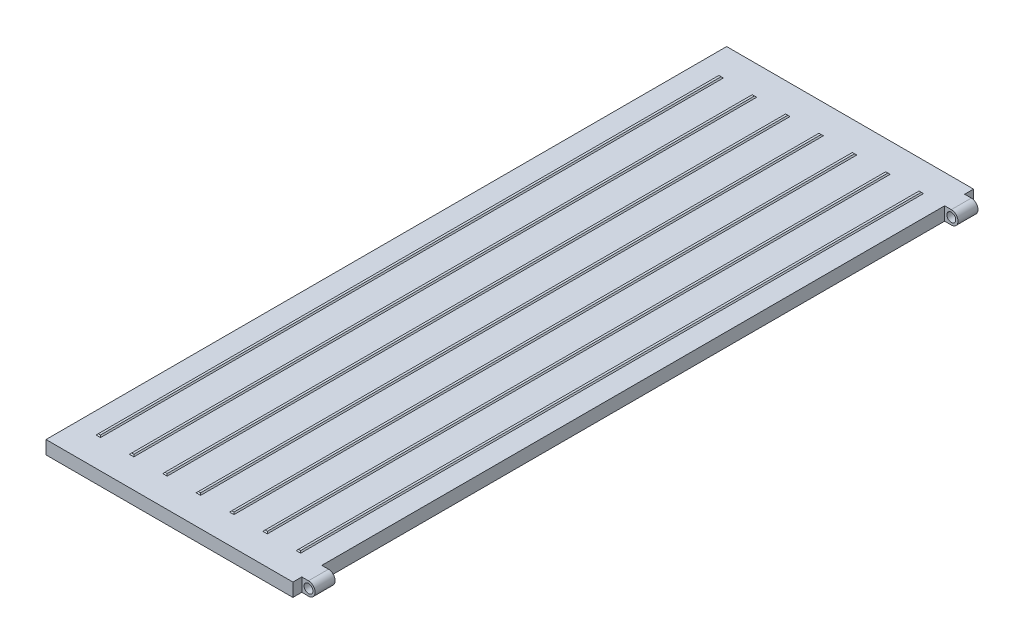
ISO-10303-21;
HEADER;
FILE_DESCRIPTION(('STEP AP214'),'2;1');
FILE_NAME('part.step','',(''),(''),'','','');
FILE_SCHEMA(('AUTOMOTIVE_DESIGN { 1 0 10303 214 1 1 1 1 }'));
ENDSEC;
DATA;
#1=APPLICATION_CONTEXT('core data for automotive mechanical design processes');
#2=APPLICATION_PROTOCOL_DEFINITION('international standard','automotive_design',2000,#1);
#3=PRODUCT_CONTEXT('',#1,'mechanical');
#4=PRODUCT('Part','Part','',(#3));
#5=PRODUCT_RELATED_PRODUCT_CATEGORY('part','',(#4));
#6=PRODUCT_DEFINITION_FORMATION('','',#4);
#7=PRODUCT_DEFINITION_CONTEXT('part definition',#1,'design');
#8=PRODUCT_DEFINITION('design','',#6,#7);
#9=PRODUCT_DEFINITION_SHAPE('','',#8);
#10=(LENGTH_UNIT() NAMED_UNIT(*) SI_UNIT(.MILLI.,.METRE.));
#11=(NAMED_UNIT(*) PLANE_ANGLE_UNIT() SI_UNIT($,.RADIAN.));
#12=(NAMED_UNIT(*) SI_UNIT($,.STERADIAN.) SOLID_ANGLE_UNIT());
#13=UNCERTAINTY_MEASURE_WITH_UNIT(LENGTH_MEASURE(1.E-05),#10,'distance_accuracy_value','');
#14=(GEOMETRIC_REPRESENTATION_CONTEXT(3) GLOBAL_UNCERTAINTY_ASSIGNED_CONTEXT((#13)) GLOBAL_UNIT_ASSIGNED_CONTEXT((#10,
#11,#12)) REPRESENTATION_CONTEXT('',''));
#15=CARTESIAN_POINT('',(0.,0.,0.));
#16=DIRECTION('',(0.,0.,1.));
#17=DIRECTION('',(1.,0.,0.));
#18=AXIS2_PLACEMENT_3D('',#15,#16,#17);
#19=CARTESIAN_POINT('',(0.,2.5,765.));
#20=DIRECTION('',(0.,-1.,0.));
#21=DIRECTION('',(1.,0.,0.));
#22=AXIS2_PLACEMENT_3D('',#19,#20,#21);
#23=PLANE('',#22);
#24=DIRECTION('',(0.,0.,-1.));
#25=VECTOR('',#24,1.);
#26=CARTESIAN_POINT('',(-22.3606797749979,2.5,745.));
#27=LINE('',#26,#25);
#28=CARTESIAN_POINT('',(-22.3606797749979,2.5,712.5));
#29=VERTEX_POINT('',#28);
#30=CARTESIAN_POINT('',(-22.3606797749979,2.5,732.5));
#31=VERTEX_POINT('',#30);
#32=EDGE_CURVE('E691',#29,#31,#27,.F.);
#33=ORIENTED_EDGE('',*,*,#32,.T.);
#34=DIRECTION('',(-1.,0.,0.));
#35=VECTOR('',#34,1.);
#36=CARTESIAN_POINT('',(0.,2.5,732.5));
#37=LINE('',#36,#35);
#38=CARTESIAN_POINT('',(-27.5,2.5,732.5));
#39=VERTEX_POINT('',#38);
#40=EDGE_CURVE('E630',#31,#39,#37,.T.);
#41=ORIENTED_EDGE('',*,*,#40,.T.);
#42=DIRECTION('',(0.,0.,-1.));
#43=VECTOR('',#42,1.);
#44=CARTESIAN_POINT('',(-27.5,2.5,765.));
#45=LINE('',#44,#43);
#46=CARTESIAN_POINT('',(-27.5,2.5,752.5));
#47=VERTEX_POINT('',#46);
#48=EDGE_CURVE('E626',#47,#39,#45,.T.);
#49=ORIENTED_EDGE('',*,*,#48,.F.);
#50=DIRECTION('',(-1.,0.,0.));
#51=VECTOR('',#50,1.);
#52=CARTESIAN_POINT('',(0.,2.5,752.5));
#53=LINE('',#52,#51);
#54=CARTESIAN_POINT('',(-557.5,2.49999999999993,752.5));
#55=VERTEX_POINT('',#54);
#56=EDGE_CURVE('E622',#47,#55,#53,.T.);
#57=ORIENTED_EDGE('',*,*,#56,.T.);
#58=DIRECTION('',(0.,0.,-1.));
#59=VECTOR('',#58,1.);
#60=CARTESIAN_POINT('',(-557.5,2.49999999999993,765.));
#61=LINE('',#60,#59);
#62=CARTESIAN_POINT('',(-557.5,2.49999999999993,-752.5));
#63=VERTEX_POINT('',#62);
#64=EDGE_CURVE('E606',#55,#63,#61,.T.);
#65=ORIENTED_EDGE('',*,*,#64,.T.);
#66=DIRECTION('',(-1.,0.,0.));
#67=VECTOR('',#66,1.);
#68=CARTESIAN_POINT('',(0.,2.5,-752.5));
#69=LINE('',#68,#67);
#70=CARTESIAN_POINT('',(-27.5,2.5,-752.5));
#71=VERTEX_POINT('',#70);
#72=EDGE_CURVE('E615',#71,#63,#69,.T.);
#73=ORIENTED_EDGE('',*,*,#72,.F.);
#74=DIRECTION('',(0.,0.,-1.));
#75=VECTOR('',#74,1.);
#76=CARTESIAN_POINT('',(-27.5,2.5,765.));
#77=LINE('',#76,#75);
#78=CARTESIAN_POINT('',(-27.5,2.5,-732.5));
#79=VERTEX_POINT('',#78);
#80=EDGE_CURVE('E603',#79,#71,#77,.T.);
#81=ORIENTED_EDGE('',*,*,#80,.F.);
#82=DIRECTION('',(-1.,0.,0.));
#83=VECTOR('',#82,1.);
#84=CARTESIAN_POINT('',(0.,2.5,-732.5));
#85=LINE('',#84,#83);
#86=CARTESIAN_POINT('',(-22.3606797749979,2.5,-732.5));
#87=VERTEX_POINT('',#86);
#88=EDGE_CURVE('E611',#87,#79,#85,.T.);
#89=ORIENTED_EDGE('',*,*,#88,.F.);
#90=DIRECTION('',(0.,0.,1.));
#91=VECTOR('',#90,1.);
#92=CARTESIAN_POINT('',(-22.3606797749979,2.5,-745.));
#93=LINE('',#92,#91);
#94=CARTESIAN_POINT('',(-22.3606797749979,2.5,-712.5));
#95=VERTEX_POINT('',#94);
#96=EDGE_CURVE('E687',#87,#95,#93,.T.);
#97=ORIENTED_EDGE('',*,*,#96,.T.);
#98=DIRECTION('',(-1.,0.,0.));
#99=VECTOR('',#98,1.);
#100=CARTESIAN_POINT('',(0.,2.5,-712.5));
#101=LINE('',#100,#99);
#102=CARTESIAN_POINT('',(-27.5,2.5,-712.5));
#103=VERTEX_POINT('',#102);
#104=EDGE_CURVE('E640',#95,#103,#101,.T.);
#105=ORIENTED_EDGE('',*,*,#104,.T.);
#106=DIRECTION('',(0.,0.,-1.));
#107=VECTOR('',#106,1.);
#108=CARTESIAN_POINT('',(-27.5,2.5,765.));
#109=LINE('',#108,#107);
#110=CARTESIAN_POINT('',(-27.5,2.5,712.5));
#111=VERTEX_POINT('',#110);
#112=EDGE_CURVE('E605',#111,#103,#109,.T.);
#113=ORIENTED_EDGE('',*,*,#112,.F.);
#114=DIRECTION('',(-1.,0.,0.));
#115=VECTOR('',#114,1.);
#116=CARTESIAN_POINT('',(0.,2.5,712.5));
#117=LINE('',#116,#115);
#118=EDGE_CURVE('E633',#29,#111,#117,.T.);
#119=ORIENTED_EDGE('',*,*,#118,.F.);
#120=EDGE_LOOP('',(#33,#41,#49,#57,#65,#73,#81,#89,#97,#105,#113,#119));
#121=FACE_BOUND('',#120,.T.);
#122=DIRECTION('',(0.,0.,1.));
#123=VECTOR('',#122,1.);
#124=CARTESIAN_POINT('',(-277.5,2.49999999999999,717.5));
#125=LINE('',#124,#123);
#126=CARTESIAN_POINT('',(-277.5,2.49999999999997,717.5));
#127=VERTEX_POINT('',#126);
#128=CARTESIAN_POINT('',(-277.5,2.49999999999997,732.5));
#129=VERTEX_POINT('',#128);
#130=EDGE_CURVE('E66',#127,#129,#125,.T.);
#131=ORIENTED_EDGE('',*,*,#130,.F.);
#132=DIRECTION('',(-1.,0.,0.));
#133=VECTOR('',#132,1.);
#134=CARTESIAN_POINT('',(-277.5,2.49999999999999,717.5));
#135=LINE('',#134,#133);
#136=CARTESIAN_POINT('',(-307.5,2.49999999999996,717.5));
#137=VERTEX_POINT('',#136);
#138=EDGE_CURVE('E454',#127,#137,#135,.T.);
#139=ORIENTED_EDGE('',*,*,#138,.T.);
#140=DIRECTION('',(0.,0.,1.));
#141=VECTOR('',#140,1.);
#142=CARTESIAN_POINT('',(-307.5,2.49999999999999,717.5));
#143=LINE('',#142,#141);
#144=CARTESIAN_POINT('',(-307.5,2.49999999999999,732.5));
#145=VERTEX_POINT('',#144);
#146=EDGE_CURVE('E466',#137,#145,#143,.T.);
#147=ORIENTED_EDGE('',*,*,#146,.T.);
#148=DIRECTION('',(-1.,0.,0.));
#149=VECTOR('',#148,1.);
#150=CARTESIAN_POINT('',(-277.5,2.49999999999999,732.5));
#151=LINE('',#150,#149);
#152=EDGE_CURVE('E452',#129,#145,#151,.T.);
#153=ORIENTED_EDGE('',*,*,#152,.F.);
#154=EDGE_LOOP('',(#131,#139,#147,#153));
#155=FACE_BOUND('',#154,.T.);
#156=DIRECTION('',(-1.,0.,0.));
#157=VECTOR('',#156,1.);
#158=CARTESIAN_POINT('',(-277.5,2.49999999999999,-732.5));
#159=LINE('',#158,#157);
#160=CARTESIAN_POINT('',(-277.5,2.49999999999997,-732.5));
#161=VERTEX_POINT('',#160);
#162=CARTESIAN_POINT('',(-307.5,2.49999999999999,-732.5));
#163=VERTEX_POINT('',#162);
#164=EDGE_CURVE('E58',#161,#163,#159,.T.);
#165=ORIENTED_EDGE('',*,*,#164,.T.);
#166=DIRECTION('',(0.,0.,-1.));
#167=VECTOR('',#166,1.);
#168=CARTESIAN_POINT('',(-307.5,2.49999999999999,-717.5));
#169=LINE('',#168,#167);
#170=CARTESIAN_POINT('',(-307.5,2.49999999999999,-717.5));
#171=VERTEX_POINT('',#170);
#172=EDGE_CURVE('E424',#171,#163,#169,.T.);
#173=ORIENTED_EDGE('',*,*,#172,.F.);
#174=DIRECTION('',(-1.,0.,0.));
#175=VECTOR('',#174,1.);
#176=CARTESIAN_POINT('',(-277.5,2.49999999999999,-717.5));
#177=LINE('',#176,#175);
#178=CARTESIAN_POINT('',(-277.5,2.49999999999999,-717.5));
#179=VERTEX_POINT('',#178);
#180=EDGE_CURVE('E430',#179,#171,#177,.T.);
#181=ORIENTED_EDGE('',*,*,#180,.F.);
#182=DIRECTION('',(0.,0.,-1.));
#183=VECTOR('',#182,1.);
#184=CARTESIAN_POINT('',(-277.5,2.49999999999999,-717.5));
#185=LINE('',#184,#183);
#186=EDGE_CURVE('E1200',#179,#161,#185,.T.);
#187=ORIENTED_EDGE('',*,*,#186,.T.);
#188=EDGE_LOOP('',(#165,#173,#181,#187));
#189=FACE_BOUND('',#188,.T.);
#190=ADVANCED_FACE('F42',(#121,#155,#189),#23,.T.);
#191=CARTESIAN_POINT('',(0.,15.,765.));
#192=DIRECTION('',(0.,-1.,0.));
#193=DIRECTION('',(1.,0.,0.));
#194=AXIS2_PLACEMENT_3D('',#191,#192,#193);
#195=PLANE('',#194);
#196=DIRECTION('',(1.,0.,0.));
#197=VECTOR('',#196,1.);
#198=CARTESIAN_POINT('',(-447.5,14.9999999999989,700.));
#199=LINE('',#198,#197);
#200=CARTESIAN_POINT('',(-447.5,14.9999999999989,700.));
#201=VERTEX_POINT('',#200);
#202=CARTESIAN_POINT('',(-437.5,14.9999999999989,700.));
#203=VERTEX_POINT('',#202);
#204=EDGE_CURVE('E511',#201,#203,#199,.T.);
#205=ORIENTED_EDGE('',*,*,#204,.F.);
#206=DIRECTION('',(0.,0.,-1.));
#207=VECTOR('',#206,1.);
#208=CARTESIAN_POINT('',(-447.5,14.9999999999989,700.));
#209=LINE('',#208,#207);
#210=CARTESIAN_POINT('',(-447.5,14.9999999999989,-700.));
#211=VERTEX_POINT('',#210);
#212=EDGE_CURVE('E508',#201,#211,#209,.T.);
#213=ORIENTED_EDGE('',*,*,#212,.T.);
#214=DIRECTION('',(1.,0.,0.));
#215=VECTOR('',#214,1.);
#216=CARTESIAN_POINT('',(-447.5,14.9999999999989,-700.));
#217=LINE('',#216,#215);
#218=CARTESIAN_POINT('',(-437.5,14.9999999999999,-700.));
#219=VERTEX_POINT('',#218);
#220=EDGE_CURVE('E512',#211,#219,#217,.T.);
#221=ORIENTED_EDGE('',*,*,#220,.T.);
#222=DIRECTION('',(0.,0.,-1.));
#223=VECTOR('',#222,1.);
#224=CARTESIAN_POINT('',(-437.5,14.9999999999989,700.));
#225=LINE('',#224,#223);
#226=EDGE_CURVE('E498',#203,#219,#225,.T.);
#227=ORIENTED_EDGE('',*,*,#226,.F.);
#228=EDGE_LOOP('',(#205,#213,#221,#227));
#229=FACE_BOUND('',#228,.T.);
#230=DIRECTION('',(1.,0.,0.));
#231=VECTOR('',#230,1.);
#232=CARTESIAN_POINT('',(-147.5,14.9999999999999,700.));
#233=LINE('',#232,#231);
#234=CARTESIAN_POINT('',(-147.5,14.9999999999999,700.));
#235=VERTEX_POINT('',#234);
#236=CARTESIAN_POINT('',(-137.5,14.9999999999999,700.));
#237=VERTEX_POINT('',#236);
#238=EDGE_CURVE('E545',#235,#237,#233,.T.);
#239=ORIENTED_EDGE('',*,*,#238,.F.);
#240=DIRECTION('',(0.,0.,-1.));
#241=VECTOR('',#240,1.);
#242=CARTESIAN_POINT('',(-147.5,14.9999999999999,700.));
#243=LINE('',#242,#241);
#244=CARTESIAN_POINT('',(-147.5,14.9999999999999,-700.));
#245=VERTEX_POINT('',#244);
#246=EDGE_CURVE('E542',#235,#245,#243,.T.);
#247=ORIENTED_EDGE('',*,*,#246,.T.);
#248=DIRECTION('',(1.,0.,0.));
#249=VECTOR('',#248,1.);
#250=CARTESIAN_POINT('',(-147.5,14.9999999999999,-700.));
#251=LINE('',#250,#249);
#252=CARTESIAN_POINT('',(-137.5,15.,-700.));
#253=VERTEX_POINT('',#252);
#254=EDGE_CURVE('E546',#245,#253,#251,.T.);
#255=ORIENTED_EDGE('',*,*,#254,.T.);
#256=DIRECTION('',(0.,0.,-1.));
#257=VECTOR('',#256,1.);
#258=CARTESIAN_POINT('',(-137.5,14.9999999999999,700.));
#259=LINE('',#258,#257);
#260=EDGE_CURVE('E532',#237,#253,#259,.T.);
#261=ORIENTED_EDGE('',*,*,#260,.F.);
#262=EDGE_LOOP('',(#239,#247,#255,#261));
#263=FACE_BOUND('',#262,.T.);
#264=DIRECTION('',(1.,0.,0.));
#265=VECTOR('',#264,1.);
#266=CARTESIAN_POINT('',(-372.5,14.9999999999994,700.));
#267=LINE('',#266,#265);
#268=CARTESIAN_POINT('',(-372.5,14.9999999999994,700.));
#269=VERTEX_POINT('',#268);
#270=CARTESIAN_POINT('',(-362.5,14.9999999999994,700.));
#271=VERTEX_POINT('',#270);
#272=EDGE_CURVE('E579',#269,#271,#267,.T.);
#273=ORIENTED_EDGE('',*,*,#272,.F.);
#274=DIRECTION('',(0.,0.,-1.));
#275=VECTOR('',#274,1.);
#276=CARTESIAN_POINT('',(-372.5,14.9999999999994,700.));
#277=LINE('',#276,#275);
#278=CARTESIAN_POINT('',(-372.5,14.9999999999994,-700.));
#279=VERTEX_POINT('',#278);
#280=EDGE_CURVE('E576',#269,#279,#277,.T.);
#281=ORIENTED_EDGE('',*,*,#280,.T.);
#282=DIRECTION('',(1.,0.,0.));
#283=VECTOR('',#282,1.);
#284=CARTESIAN_POINT('',(-372.5,14.9999999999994,-700.));
#285=LINE('',#284,#283);
#286=CARTESIAN_POINT('',(-362.5,15.,-700.));
#287=VERTEX_POINT('',#286);
#288=EDGE_CURVE('E580',#279,#287,#285,.T.);
#289=ORIENTED_EDGE('',*,*,#288,.T.);
#290=DIRECTION('',(0.,0.,-1.));
#291=VECTOR('',#290,1.);
#292=CARTESIAN_POINT('',(-362.5,14.9999999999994,700.));
#293=LINE('',#292,#291);
#294=EDGE_CURVE('E566',#271,#287,#293,.T.);
#295=ORIENTED_EDGE('',*,*,#294,.F.);
#296=EDGE_LOOP('',(#273,#281,#289,#295));
#297=FACE_BOUND('',#296,.T.);
#298=DIRECTION('',(-1.,0.,0.));
#299=VECTOR('',#298,1.);
#300=CARTESIAN_POINT('',(0.,15.,-765.));
#301=LINE('',#300,#299);
#302=CARTESIAN_POINT('',(-15.,15.,-765.));
#303=VERTEX_POINT('',#302);
#304=CARTESIAN_POINT('',(-570.,14.9999999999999,-765.));
#305=VERTEX_POINT('',#304);
#306=EDGE_CURVE('E774',#303,#305,#301,.T.);
#307=ORIENTED_EDGE('',*,*,#306,.T.);
#308=DIRECTION('',(0.,0.,-1.));
#309=VECTOR('',#308,1.);
#310=CARTESIAN_POINT('',(-570.,14.9999999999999,765.));
#311=LINE('',#310,#309);
#312=CARTESIAN_POINT('',(-570.,14.9999999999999,765.));
#313=VERTEX_POINT('',#312);
#314=EDGE_CURVE('E786',#313,#305,#311,.T.);
#315=ORIENTED_EDGE('',*,*,#314,.F.);
#316=DIRECTION('',(-1.,0.,0.));
#317=VECTOR('',#316,1.);
#318=CARTESIAN_POINT('',(0.,15.,765.));
#319=LINE('',#318,#317);
#320=CARTESIAN_POINT('',(-15.,15.,765.));
#321=VERTEX_POINT('',#320);
#322=EDGE_CURVE('E764',#321,#313,#319,.T.);
#323=ORIENTED_EDGE('',*,*,#322,.F.);
#324=DIRECTION('',(0.,0.,-1.));
#325=VECTOR('',#324,1.);
#326=CARTESIAN_POINT('',(-15.,15.,765.));
#327=LINE('',#326,#325);
#328=CARTESIAN_POINT('',(-15.,15.,745.));
#329=VERTEX_POINT('',#328);
#330=EDGE_CURVE('E790',#321,#329,#327,.T.);
#331=ORIENTED_EDGE('',*,*,#330,.T.);
#332=DIRECTION('',(-1.,0.,0.));
#333=VECTOR('',#332,1.);
#334=CARTESIAN_POINT('',(0.,15.,745.));
#335=LINE('',#334,#333);
#336=CARTESIAN_POINT('',(0.,15.,745.));
#337=VERTEX_POINT('',#336);
#338=EDGE_CURVE('E737',#337,#329,#335,.T.);
#339=ORIENTED_EDGE('',*,*,#338,.F.);
#340=DIRECTION('',(0.,0.,-1.));
#341=VECTOR('',#340,1.);
#342=CARTESIAN_POINT('',(0.,15.,745.));
#343=LINE('',#342,#341);
#344=CARTESIAN_POINT('',(0.,15.,700.));
#345=VERTEX_POINT('',#344);
#346=EDGE_CURVE('E743',#337,#345,#343,.T.);
#347=ORIENTED_EDGE('',*,*,#346,.T.);
#348=DIRECTION('',(-1.,0.,0.));
#349=VECTOR('',#348,1.);
#350=CARTESIAN_POINT('',(0.,15.,700.));
#351=LINE('',#350,#349);
#352=CARTESIAN_POINT('',(-15.,15.,700.));
#353=VERTEX_POINT('',#352);
#354=EDGE_CURVE('E751',#345,#353,#351,.T.);
#355=ORIENTED_EDGE('',*,*,#354,.T.);
#356=CARTESIAN_POINT('',(-15.,15.,-700.));
#357=VERTEX_POINT('',#356);
#358=EDGE_CURVE('E794',#353,#357,#327,.T.);
#359=ORIENTED_EDGE('',*,*,#358,.T.);
#360=DIRECTION('',(-1.,0.,0.));
#361=VECTOR('',#360,1.);
#362=CARTESIAN_POINT('',(0.,15.,-700.));
#363=LINE('',#362,#361);
#364=CARTESIAN_POINT('',(0.,15.,-700.));
#365=VERTEX_POINT('',#364);
#366=EDGE_CURVE('E719',#365,#357,#363,.T.);
#367=ORIENTED_EDGE('',*,*,#366,.F.);
#368=DIRECTION('',(0.,0.,1.));
#369=VECTOR('',#368,1.);
#370=CARTESIAN_POINT('',(0.,15.,-745.));
#371=LINE('',#370,#369);
#372=CARTESIAN_POINT('',(0.,15.,-745.));
#373=VERTEX_POINT('',#372);
#374=EDGE_CURVE('E724',#373,#365,#371,.T.);
#375=ORIENTED_EDGE('',*,*,#374,.F.);
#376=DIRECTION('',(-1.,0.,0.));
#377=VECTOR('',#376,1.);
#378=CARTESIAN_POINT('',(0.,15.,-745.));
#379=LINE('',#378,#377);
#380=CARTESIAN_POINT('',(-15.,15.,-745.));
#381=VERTEX_POINT('',#380);
#382=EDGE_CURVE('E704',#373,#381,#379,.T.);
#383=ORIENTED_EDGE('',*,*,#382,.T.);
#384=EDGE_CURVE('E789',#381,#303,#327,.T.);
#385=ORIENTED_EDGE('',*,*,#384,.T.);
#386=EDGE_LOOP('',(#307,#315,#323,#331,#339,#347,#355,#359,#367,#375,#383,#385));
#387=FACE_BOUND('',#386,.T.);
#388=DIRECTION('',(1.,0.,0.));
#389=VECTOR('',#388,1.);
#390=CARTESIAN_POINT('',(-297.5,14.9999999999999,700.));
#391=LINE('',#390,#389);
#392=CARTESIAN_POINT('',(-297.5,14.9999999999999,700.));
#393=VERTEX_POINT('',#392);
#394=CARTESIAN_POINT('',(-287.5,14.9999999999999,700.));
#395=VERTEX_POINT('',#394);
#396=EDGE_CURVE('E586',#393,#395,#391,.T.);
#397=ORIENTED_EDGE('',*,*,#396,.F.);
#398=DIRECTION('',(0.,0.,-1.));
#399=VECTOR('',#398,1.);
#400=CARTESIAN_POINT('',(-297.5,14.9999999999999,700.));
#401=LINE('',#400,#399);
#402=CARTESIAN_POINT('',(-297.5,14.9999999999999,-700.));
#403=VERTEX_POINT('',#402);
#404=EDGE_CURVE('E593',#393,#403,#401,.T.);
#405=ORIENTED_EDGE('',*,*,#404,.T.);
#406=DIRECTION('',(1.,0.,0.));
#407=VECTOR('',#406,1.);
#408=CARTESIAN_POINT('',(-297.5,14.9999999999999,-700.));
#409=LINE('',#408,#407);
#410=CARTESIAN_POINT('',(-287.5,15.,-700.));
#411=VERTEX_POINT('',#410);
#412=EDGE_CURVE('E583',#403,#411,#409,.T.);
#413=ORIENTED_EDGE('',*,*,#412,.T.);
#414=DIRECTION('',(0.,0.,-1.));
#415=VECTOR('',#414,1.);
#416=CARTESIAN_POINT('',(-287.5,14.9999999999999,700.));
#417=LINE('',#416,#415);
#418=EDGE_CURVE('E589',#395,#411,#417,.T.);
#419=ORIENTED_EDGE('',*,*,#418,.F.);
#420=EDGE_LOOP('',(#397,#405,#413,#419));
#421=FACE_BOUND('',#420,.T.);
#422=DIRECTION('',(1.,0.,0.));
#423=VECTOR('',#422,1.);
#424=CARTESIAN_POINT('',(-222.5,14.9999999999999,700.));
#425=LINE('',#424,#423);
#426=CARTESIAN_POINT('',(-222.5,14.9999999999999,700.));
#427=VERTEX_POINT('',#426);
#428=CARTESIAN_POINT('',(-212.5,14.9999999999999,700.));
#429=VERTEX_POINT('',#428);
#430=EDGE_CURVE('E562',#427,#429,#425,.T.);
#431=ORIENTED_EDGE('',*,*,#430,.F.);
#432=DIRECTION('',(0.,0.,-1.));
#433=VECTOR('',#432,1.);
#434=CARTESIAN_POINT('',(-222.5,14.9999999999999,700.));
#435=LINE('',#434,#433);
#436=CARTESIAN_POINT('',(-222.5,14.9999999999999,-700.));
#437=VERTEX_POINT('',#436);
#438=EDGE_CURVE('E559',#427,#437,#435,.T.);
#439=ORIENTED_EDGE('',*,*,#438,.T.);
#440=DIRECTION('',(1.,0.,0.));
#441=VECTOR('',#440,1.);
#442=CARTESIAN_POINT('',(-222.5,14.9999999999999,-700.));
#443=LINE('',#442,#441);
#444=CARTESIAN_POINT('',(-212.5,15.,-700.));
#445=VERTEX_POINT('',#444);
#446=EDGE_CURVE('E563',#437,#445,#443,.T.);
#447=ORIENTED_EDGE('',*,*,#446,.T.);
#448=DIRECTION('',(0.,0.,-1.));
#449=VECTOR('',#448,1.);
#450=CARTESIAN_POINT('',(-212.5,14.9999999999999,700.));
#451=LINE('',#450,#449);
#452=EDGE_CURVE('E549',#429,#445,#451,.T.);
#453=ORIENTED_EDGE('',*,*,#452,.F.);
#454=EDGE_LOOP('',(#431,#439,#447,#453));
#455=FACE_BOUND('',#454,.T.);
#456=DIRECTION('',(1.,0.,0.));
#457=VECTOR('',#456,1.);
#458=CARTESIAN_POINT('',(-72.5,14.9999999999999,700.));
#459=LINE('',#458,#457);
#460=CARTESIAN_POINT('',(-72.5,14.9999999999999,700.));
#461=VERTEX_POINT('',#460);
#462=CARTESIAN_POINT('',(-62.5,14.9999999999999,700.));
#463=VERTEX_POINT('',#462);
#464=EDGE_CURVE('E528',#461,#463,#459,.T.);
#465=ORIENTED_EDGE('',*,*,#464,.F.);
#466=DIRECTION('',(0.,0.,-1.));
#467=VECTOR('',#466,1.);
#468=CARTESIAN_POINT('',(-72.5,14.9999999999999,700.));
#469=LINE('',#468,#467);
#470=CARTESIAN_POINT('',(-72.5,14.9999999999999,-700.));
#471=VERTEX_POINT('',#470);
#472=EDGE_CURVE('E525',#461,#471,#469,.T.);
#473=ORIENTED_EDGE('',*,*,#472,.T.);
#474=DIRECTION('',(1.,0.,0.));
#475=VECTOR('',#474,1.);
#476=CARTESIAN_POINT('',(-72.5,14.9999999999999,-700.));
#477=LINE('',#476,#475);
#478=CARTESIAN_POINT('',(-62.5,15.,-700.));
#479=VERTEX_POINT('',#478);
#480=EDGE_CURVE('E529',#471,#479,#477,.T.);
#481=ORIENTED_EDGE('',*,*,#480,.T.);
#482=DIRECTION('',(0.,0.,-1.));
#483=VECTOR('',#482,1.);
#484=CARTESIAN_POINT('',(-62.5,14.9999999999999,700.));
#485=LINE('',#484,#483);
#486=EDGE_CURVE('E515',#463,#479,#485,.T.);
#487=ORIENTED_EDGE('',*,*,#486,.F.);
#488=EDGE_LOOP('',(#465,#473,#481,#487));
#489=FACE_BOUND('',#488,.T.);
#490=DIRECTION('',(1.,0.,0.));
#491=VECTOR('',#490,1.);
#492=CARTESIAN_POINT('',(-522.5,14.9999999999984,700.));
#493=LINE('',#492,#491);
#494=CARTESIAN_POINT('',(-522.5,14.9999999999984,700.));
#495=VERTEX_POINT('',#494);
#496=CARTESIAN_POINT('',(-512.5,14.9999999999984,700.));
#497=VERTEX_POINT('',#496);
#498=EDGE_CURVE('E494',#495,#497,#493,.T.);
#499=ORIENTED_EDGE('',*,*,#498,.F.);
#500=DIRECTION('',(0.,0.,-1.));
#501=VECTOR('',#500,1.);
#502=CARTESIAN_POINT('',(-522.5,14.9999999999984,700.));
#503=LINE('',#502,#501);
#504=CARTESIAN_POINT('',(-522.5,14.9999999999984,-700.));
#505=VERTEX_POINT('',#504);
#506=EDGE_CURVE('E491',#495,#505,#503,.T.);
#507=ORIENTED_EDGE('',*,*,#506,.T.);
#508=DIRECTION('',(1.,0.,0.));
#509=VECTOR('',#508,1.);
#510=CARTESIAN_POINT('',(-522.5,14.9999999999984,-700.));
#511=LINE('',#510,#509);
#512=CARTESIAN_POINT('',(-512.5,14.9999999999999,-700.));
#513=VERTEX_POINT('',#512);
#514=EDGE_CURVE('E495',#505,#513,#511,.T.);
#515=ORIENTED_EDGE('',*,*,#514,.T.);
#516=DIRECTION('',(0.,0.,-1.));
#517=VECTOR('',#516,1.);
#518=CARTESIAN_POINT('',(-512.5,14.9999999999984,700.));
#519=LINE('',#518,#517);
#520=EDGE_CURVE('E478',#497,#513,#519,.T.);
#521=ORIENTED_EDGE('',*,*,#520,.F.);
#522=EDGE_LOOP('',(#499,#507,#515,#521));
#523=FACE_BOUND('',#522,.T.);
#524=ADVANCED_FACE('F889',(#229,#263,#297,#387,#421,#455,#489,#523),#195,.F.);
#525=CARTESIAN_POINT('',(0.,-15.,765.));
#526=DIRECTION('',(0.,1.,0.));
#527=DIRECTION('',(-1.,0.,0.));
#528=AXIS2_PLACEMENT_3D('',#525,#526,#527);
#529=PLANE('',#528);
#530=DIRECTION('',(1.,0.,0.));
#531=VECTOR('',#530,1.);
#532=CARTESIAN_POINT('',(0.,-15.,-765.));
#533=LINE('',#532,#531);
#534=CARTESIAN_POINT('',(-570.,-14.9999999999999,-765.));
#535=VERTEX_POINT('',#534);
#536=CARTESIAN_POINT('',(-15.,-15.,-765.));
#537=VERTEX_POINT('',#536);
#538=EDGE_CURVE('E765',#535,#537,#533,.T.);
#539=ORIENTED_EDGE('',*,*,#538,.T.);
#540=DIRECTION('',(0.,0.,-1.));
#541=VECTOR('',#540,1.);
#542=CARTESIAN_POINT('',(-15.,-15.,765.));
#543=LINE('',#542,#541);
#544=CARTESIAN_POINT('',(-15.,-15.,-745.));
#545=VERTEX_POINT('',#544);
#546=EDGE_CURVE('E771',#545,#537,#543,.T.);
#547=ORIENTED_EDGE('',*,*,#546,.F.);
#548=DIRECTION('',(1.,0.,0.));
#549=VECTOR('',#548,1.);
#550=CARTESIAN_POINT('',(0.,-15.,-745.));
#551=LINE('',#550,#549);
#552=CARTESIAN_POINT('',(0.,-15.,-745.));
#553=VERTEX_POINT('',#552);
#554=EDGE_CURVE('E697',#545,#553,#551,.T.);
#555=ORIENTED_EDGE('',*,*,#554,.T.);
#556=DIRECTION('',(0.,0.,1.));
#557=VECTOR('',#556,1.);
#558=CARTESIAN_POINT('',(0.,-15.,-745.));
#559=LINE('',#558,#557);
#560=CARTESIAN_POINT('',(0.,-15.,-700.));
#561=VERTEX_POINT('',#560);
#562=EDGE_CURVE('E710',#553,#561,#559,.T.);
#563=ORIENTED_EDGE('',*,*,#562,.T.);
#564=DIRECTION('',(1.,0.,0.));
#565=VECTOR('',#564,1.);
#566=CARTESIAN_POINT('',(0.,-15.,-700.));
#567=LINE('',#566,#565);
#568=CARTESIAN_POINT('',(-15.,-15.,-700.));
#569=VERTEX_POINT('',#568);
#570=EDGE_CURVE('E713',#569,#561,#567,.T.);
#571=ORIENTED_EDGE('',*,*,#570,.F.);
#572=CARTESIAN_POINT('',(-15.,-15.,700.));
#573=VERTEX_POINT('',#572);
#574=EDGE_CURVE('E783',#573,#569,#543,.T.);
#575=ORIENTED_EDGE('',*,*,#574,.F.);
#576=DIRECTION('',(1.,0.,0.));
#577=VECTOR('',#576,1.);
#578=CARTESIAN_POINT('',(0.,-15.,700.));
#579=LINE('',#578,#577);
#580=CARTESIAN_POINT('',(0.,-15.,700.));
#581=VERTEX_POINT('',#580);
#582=EDGE_CURVE('E746',#573,#581,#579,.T.);
#583=ORIENTED_EDGE('',*,*,#582,.T.);
#584=DIRECTION('',(0.,0.,-1.));
#585=VECTOR('',#584,1.);
#586=CARTESIAN_POINT('',(0.,-15.,745.));
#587=LINE('',#586,#585);
#588=CARTESIAN_POINT('',(0.,-15.,745.));
#589=VERTEX_POINT('',#588);
#590=EDGE_CURVE('E757',#589,#581,#587,.T.);
#591=ORIENTED_EDGE('',*,*,#590,.F.);
#592=DIRECTION('',(1.,0.,0.));
#593=VECTOR('',#592,1.);
#594=CARTESIAN_POINT('',(0.,-15.,745.));
#595=LINE('',#594,#593);
#596=CARTESIAN_POINT('',(-15.,-15.,745.));
#597=VERTEX_POINT('',#596);
#598=EDGE_CURVE('E731',#597,#589,#595,.T.);
#599=ORIENTED_EDGE('',*,*,#598,.F.);
#600=CARTESIAN_POINT('',(-15.,-15.,765.));
#601=VERTEX_POINT('',#600);
#602=EDGE_CURVE('E780',#601,#597,#543,.T.);
#603=ORIENTED_EDGE('',*,*,#602,.F.);
#604=DIRECTION('',(1.,0.,0.));
#605=VECTOR('',#604,1.);
#606=CARTESIAN_POINT('',(0.,-15.,765.));
#607=LINE('',#606,#605);
#608=CARTESIAN_POINT('',(-570.,-14.9999999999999,765.));
#609=VERTEX_POINT('',#608);
#610=EDGE_CURVE('E769',#609,#601,#607,.T.);
#611=ORIENTED_EDGE('',*,*,#610,.F.);
#612=DIRECTION('',(0.,0.,-1.));
#613=VECTOR('',#612,1.);
#614=CARTESIAN_POINT('',(-570.,-14.9999999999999,765.));
#615=LINE('',#614,#613);
#616=EDGE_CURVE('E782',#609,#535,#615,.T.);
#617=ORIENTED_EDGE('',*,*,#616,.T.);
#618=EDGE_LOOP('',(#539,#547,#555,#563,#571,#575,#583,#591,#599,#603,#611,#617));
#619=FACE_BOUND('',#618,.T.);
#620=DIRECTION('',(1.,0.,0.));
#621=VECTOR('',#620,1.);
#622=CARTESIAN_POINT('',(0.,-15.,712.5));
#623=LINE('',#622,#621);
#624=CARTESIAN_POINT('',(-27.5,-15.,712.5));
#625=VERTEX_POINT('',#624);
#626=CARTESIAN_POINT('',(-16.7705098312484,-15.,712.5));
#627=VERTEX_POINT('',#626);
#628=EDGE_CURVE('E637',#625,#627,#623,.T.);
#629=ORIENTED_EDGE('',*,*,#628,.F.);
#630=DIRECTION('',(0.,0.,-1.));
#631=VECTOR('',#630,1.);
#632=CARTESIAN_POINT('',(-27.5,-15.,765.));
#633=LINE('',#632,#631);
#634=CARTESIAN_POINT('',(-27.5,-15.,-712.5));
#635=VERTEX_POINT('',#634);
#636=EDGE_CURVE('E669',#625,#635,#633,.T.);
#637=ORIENTED_EDGE('',*,*,#636,.T.);
#638=DIRECTION('',(1.,0.,0.));
#639=VECTOR('',#638,1.);
#640=CARTESIAN_POINT('',(0.,-15.,-712.5));
#641=LINE('',#640,#639);
#642=CARTESIAN_POINT('',(-16.7705098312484,-15.,-712.5));
#643=VERTEX_POINT('',#642);
#644=EDGE_CURVE('E643',#635,#643,#641,.T.);
#645=ORIENTED_EDGE('',*,*,#644,.T.);
#646=DIRECTION('',(0.,0.,1.));
#647=VECTOR('',#646,1.);
#648=CARTESIAN_POINT('',(-16.7705098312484,-15.,-745.));
#649=LINE('',#648,#647);
#650=CARTESIAN_POINT('',(-16.7705098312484,-15.,-732.5));
#651=VERTEX_POINT('',#650);
#652=EDGE_CURVE('E629',#651,#643,#649,.T.);
#653=ORIENTED_EDGE('',*,*,#652,.F.);
#654=DIRECTION('',(1.,0.,0.));
#655=VECTOR('',#654,1.);
#656=CARTESIAN_POINT('',(0.,-15.,-732.5));
#657=LINE('',#656,#655);
#658=CARTESIAN_POINT('',(-27.5,-15.,-732.5));
#659=VERTEX_POINT('',#658);
#660=EDGE_CURVE('E646',#659,#651,#657,.T.);
#661=ORIENTED_EDGE('',*,*,#660,.F.);
#662=DIRECTION('',(0.,0.,-1.));
#663=VECTOR('',#662,1.);
#664=CARTESIAN_POINT('',(-27.5,-15.,765.));
#665=LINE('',#664,#663);
#666=CARTESIAN_POINT('',(-27.5,-15.,-752.5));
#667=VERTEX_POINT('',#666);
#668=EDGE_CURVE('E666',#659,#667,#665,.T.);
#669=ORIENTED_EDGE('',*,*,#668,.T.);
#670=DIRECTION('',(1.,0.,0.));
#671=VECTOR('',#670,1.);
#672=CARTESIAN_POINT('',(0.,-15.,-752.5));
#673=LINE('',#672,#671);
#674=CARTESIAN_POINT('',(-557.5,-14.9999999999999,-752.5));
#675=VERTEX_POINT('',#674);
#676=EDGE_CURVE('E658',#675,#667,#673,.T.);
#677=ORIENTED_EDGE('',*,*,#676,.F.);
#678=DIRECTION('',(0.,0.,-1.));
#679=VECTOR('',#678,1.);
#680=CARTESIAN_POINT('',(-557.5,-14.9999999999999,765.));
#681=LINE('',#680,#679);
#682=CARTESIAN_POINT('',(-557.5,-14.9999999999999,752.5));
#683=VERTEX_POINT('',#682);
#684=EDGE_CURVE('E621',#683,#675,#681,.T.);
#685=ORIENTED_EDGE('',*,*,#684,.F.);
#686=DIRECTION('',(1.,0.,0.));
#687=VECTOR('',#686,1.);
#688=CARTESIAN_POINT('',(0.,-15.,752.5));
#689=LINE('',#688,#687);
#690=CARTESIAN_POINT('',(-27.5,-15.,752.5));
#691=VERTEX_POINT('',#690);
#692=EDGE_CURVE('E660',#683,#691,#689,.T.);
#693=ORIENTED_EDGE('',*,*,#692,.T.);
#694=DIRECTION('',(0.,0.,-1.));
#695=VECTOR('',#694,1.);
#696=CARTESIAN_POINT('',(-27.5,-15.,765.));
#697=LINE('',#696,#695);
#698=CARTESIAN_POINT('',(-27.5,-15.,732.5));
#699=VERTEX_POINT('',#698);
#700=EDGE_CURVE('E675',#691,#699,#697,.T.);
#701=ORIENTED_EDGE('',*,*,#700,.T.);
#702=DIRECTION('',(1.,0.,0.));
#703=VECTOR('',#702,1.);
#704=CARTESIAN_POINT('',(0.,-15.,732.5));
#705=LINE('',#704,#703);
#706=CARTESIAN_POINT('',(-16.7705098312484,-15.,732.5));
#707=VERTEX_POINT('',#706);
#708=EDGE_CURVE('E632',#699,#707,#705,.T.);
#709=ORIENTED_EDGE('',*,*,#708,.T.);
#710=DIRECTION('',(0.,0.,-1.));
#711=VECTOR('',#710,1.);
#712=CARTESIAN_POINT('',(-16.7705098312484,-15.,745.));
#713=LINE('',#712,#711);
#714=EDGE_CURVE('E689',#627,#707,#713,.F.);
#715=ORIENTED_EDGE('',*,*,#714,.F.);
#716=EDGE_LOOP('',(#629,#637,#645,#653,#661,#669,#677,#685,#693,#701,#709,#715));
#717=FACE_BOUND('',#716,.T.);
#718=ADVANCED_FACE('F919',(#619,#717),#529,.F.);
#719=CARTESIAN_POINT('',(-15.,0.,765.));
#720=DIRECTION('',(1.,0.,0.));
#721=DIRECTION('',(0.,0.,-1.));
#722=AXIS2_PLACEMENT_3D('',#719,#720,#721);
#723=PLANE('',#722);
#724=ORIENTED_EDGE('',*,*,#384,.F.);
#725=DIRECTION('',(0.,-1.,0.));
#726=VECTOR('',#725,1.);
#727=CARTESIAN_POINT('',(-15.,0.,-745.));
#728=LINE('',#727,#726);
#729=EDGE_CURVE('E707',#381,#545,#728,.T.);
#730=ORIENTED_EDGE('',*,*,#729,.T.);
#731=ORIENTED_EDGE('',*,*,#546,.T.);
#732=DIRECTION('',(0.,-1.,0.));
#733=VECTOR('',#732,1.);
#734=CARTESIAN_POINT('',(-15.,0.,-765.));
#735=LINE('',#734,#733);
#736=EDGE_CURVE('E760',#303,#537,#735,.T.);
#737=ORIENTED_EDGE('',*,*,#736,.F.);
#738=EDGE_LOOP('',(#724,#730,#731,#737));
#739=FACE_BOUND('',#738,.T.);
#740=ADVANCED_FACE('F1007',(#739),#723,.T.);
#741=DIRECTION('',(0.,-1.,0.));
#742=VECTOR('',#741,1.);
#743=CARTESIAN_POINT('',(-15.,0.,-700.));
#744=LINE('',#743,#742);
#745=EDGE_CURVE('E698',#357,#569,#744,.T.);
#746=ORIENTED_EDGE('',*,*,#745,.F.);
#747=ORIENTED_EDGE('',*,*,#358,.F.);
#748=DIRECTION('',(0.,-1.,0.));
#749=VECTOR('',#748,1.);
#750=CARTESIAN_POINT('',(-15.,0.,700.));
#751=LINE('',#750,#749);
#752=EDGE_CURVE('E732',#353,#573,#751,.T.);
#753=ORIENTED_EDGE('',*,*,#752,.T.);
#754=ORIENTED_EDGE('',*,*,#574,.T.);
#755=EDGE_LOOP('',(#746,#747,#753,#754));
#756=FACE_BOUND('',#755,.T.);
#757=ADVANCED_FACE('F1015',(#756),#723,.T.);
#758=DIRECTION('',(0.,-1.,0.));
#759=VECTOR('',#758,1.);
#760=CARTESIAN_POINT('',(-15.,0.,745.));
#761=LINE('',#760,#759);
#762=EDGE_CURVE('E740',#329,#597,#761,.T.);
#763=ORIENTED_EDGE('',*,*,#762,.F.);
#764=ORIENTED_EDGE('',*,*,#330,.F.);
#765=DIRECTION('',(0.,-1.,0.));
#766=VECTOR('',#765,1.);
#767=CARTESIAN_POINT('',(-15.,0.,765.));
#768=LINE('',#767,#766);
#769=EDGE_CURVE('E761',#321,#601,#768,.T.);
#770=ORIENTED_EDGE('',*,*,#769,.T.);
#771=ORIENTED_EDGE('',*,*,#602,.T.);
#772=EDGE_LOOP('',(#763,#764,#770,#771));
#773=FACE_BOUND('',#772,.T.);
#774=ADVANCED_FACE('F1010',(#773),#723,.T.);
#775=CARTESIAN_POINT('',(-570.,0.,765.));
#776=DIRECTION('',(1.,0.,0.));
#777=DIRECTION('',(0.,0.,-1.));
#778=AXIS2_PLACEMENT_3D('',#775,#776,#777);
#779=PLANE('',#778);
#780=DIRECTION('',(0.,-1.,0.));
#781=VECTOR('',#780,1.);
#782=CARTESIAN_POINT('',(-570.,0.,-765.));
#783=LINE('',#782,#781);
#784=EDGE_CURVE('E776',#305,#535,#783,.T.);
#785=ORIENTED_EDGE('',*,*,#784,.T.);
#786=ORIENTED_EDGE('',*,*,#616,.F.);
#787=DIRECTION('',(0.,-1.,0.));
#788=VECTOR('',#787,1.);
#789=CARTESIAN_POINT('',(-570.,0.,765.));
#790=LINE('',#789,#788);
#791=EDGE_CURVE('E767',#313,#609,#790,.T.);
#792=ORIENTED_EDGE('',*,*,#791,.F.);
#793=ORIENTED_EDGE('',*,*,#314,.T.);
#794=EDGE_LOOP('',(#785,#786,#792,#793));
#795=FACE_BOUND('',#794,.T.);
#796=ADVANCED_FACE('F1000',(#795),#779,.F.);
#797=CARTESIAN_POINT('',(0.,0.,765.));
#798=DIRECTION('',(0.,0.,1.));
#799=DIRECTION('',(1.,0.,0.));
#800=AXIS2_PLACEMENT_3D('',#797,#798,#799);
#801=PLANE('',#800);
#802=ORIENTED_EDGE('',*,*,#769,.F.);
#803=ORIENTED_EDGE('',*,*,#322,.T.);
#804=ORIENTED_EDGE('',*,*,#791,.T.);
#805=ORIENTED_EDGE('',*,*,#610,.T.);
#806=EDGE_LOOP('',(#802,#803,#804,#805));
#807=FACE_BOUND('',#806,.T.);
#808=ADVANCED_FACE('F997',(#807),#801,.T.);
#809=CARTESIAN_POINT('',(0.,0.,-765.));
#810=DIRECTION('',(0.,0.,1.));
#811=DIRECTION('',(1.,0.,0.));
#812=AXIS2_PLACEMENT_3D('',#809,#810,#811);
#813=PLANE('',#812);
#814=ORIENTED_EDGE('',*,*,#736,.T.);
#815=ORIENTED_EDGE('',*,*,#538,.F.);
#816=ORIENTED_EDGE('',*,*,#784,.F.);
#817=ORIENTED_EDGE('',*,*,#306,.F.);
#818=EDGE_LOOP('',(#814,#815,#816,#817));
#819=FACE_BOUND('',#818,.T.);
#820=ADVANCED_FACE('F992',(#819),#813,.F.);
#821=CARTESIAN_POINT('',(0.,0.,745.));
#822=DIRECTION('',(0.,0.,-1.));
#823=DIRECTION('',(-1.,0.,0.));
#824=AXIS2_PLACEMENT_3D('',#821,#822,#823);
#825=CYLINDRICAL_SURFACE('',#824,15.);
#826=CARTESIAN_POINT('',(0.,0.,700.));
#827=DIRECTION('',(0.,0.,1.));
#828=DIRECTION('',(1.,0.,0.));
#829=AXIS2_PLACEMENT_3D('',#826,#827,#828);
#830=CIRCLE('',#829,15.);
#831=EDGE_CURVE('E749',#581,#345,#830,.T.);
#832=ORIENTED_EDGE('',*,*,#831,.T.);
#833=ORIENTED_EDGE('',*,*,#346,.F.);
#834=CARTESIAN_POINT('',(0.,0.,745.));
#835=DIRECTION('',(0.,0.,1.));
#836=DIRECTION('',(1.,0.,0.));
#837=AXIS2_PLACEMENT_3D('',#834,#835,#836);
#838=CIRCLE('',#837,15.);
#839=EDGE_CURVE('E735',#589,#337,#838,.T.);
#840=ORIENTED_EDGE('',*,*,#839,.F.);
#841=ORIENTED_EDGE('',*,*,#590,.T.);
#842=EDGE_LOOP('',(#832,#833,#840,#841));
#843=FACE_BOUND('',#842,.T.);
#844=ADVANCED_FACE('F989',(#843),#825,.T.);
#845=CARTESIAN_POINT('',(0.,0.,745.));
#846=DIRECTION('',(0.,0.,-1.));
#847=DIRECTION('',(-1.,0.,0.));
#848=AXIS2_PLACEMENT_3D('',#845,#846,#847);
#849=CYLINDRICAL_SURFACE('',#848,10.);
#850=CARTESIAN_POINT('',(0.,0.,745.));
#851=DIRECTION('',(0.,0.,1.));
#852=DIRECTION('',(1.,0.,0.));
#853=AXIS2_PLACEMENT_3D('',#850,#851,#852);
#854=CIRCLE('',#853,10.);
#855=CARTESIAN_POINT('',(-10.,0.,745.));
#856=VERTEX_POINT('',#855);
#857=EDGE_CURVE('E728',#856,#856,#854,.T.);
#858=CARTESIAN_POINT('',(0.,0.,700.));
#859=DIRECTION('',(0.,0.,1.));
#860=DIRECTION('',(1.,0.,0.));
#861=AXIS2_PLACEMENT_3D('',#858,#859,#860);
#862=CIRCLE('',#861,10.);
#863=CARTESIAN_POINT('',(-10.,0.,700.));
#864=VERTEX_POINT('',#863);
#865=EDGE_CURVE('E726',#864,#864,#862,.T.);
#866=CARTESIAN_POINT('',(-10.,0.,745.));
#867=CARTESIAN_POINT('',(-10.,0.,744.53125));
#868=CARTESIAN_POINT('',(-10.,0.,744.0625));
#869=CARTESIAN_POINT('',(-10.,0.,743.125));
#870=CARTESIAN_POINT('',(-10.,0.,742.65625));
#871=CARTESIAN_POINT('',(-10.,0.,741.71875));
#872=CARTESIAN_POINT('',(-10.,0.,741.25));
#873=CARTESIAN_POINT('',(-10.,0.,740.3125));
#874=CARTESIAN_POINT('',(-10.,0.,739.84375));
#875=CARTESIAN_POINT('',(-10.,0.,738.90625));
#876=CARTESIAN_POINT('',(-10.,0.,738.4375));
#877=CARTESIAN_POINT('',(-10.,0.,737.5));
#878=CARTESIAN_POINT('',(-10.,0.,737.03125));
#879=CARTESIAN_POINT('',(-10.,0.,736.09375));
#880=CARTESIAN_POINT('',(-10.,0.,735.625));
#881=CARTESIAN_POINT('',(-10.,0.,734.6875));
#882=CARTESIAN_POINT('',(-10.,0.,734.21875));
#883=CARTESIAN_POINT('',(-10.,0.,733.28125));
#884=CARTESIAN_POINT('',(-10.,0.,732.8125));
#885=CARTESIAN_POINT('',(-10.,0.,731.875));
#886=CARTESIAN_POINT('',(-10.,0.,731.40625));
#887=CARTESIAN_POINT('',(-10.,0.,730.46875));
#888=CARTESIAN_POINT('',(-10.,0.,730.));
#889=CARTESIAN_POINT('',(-10.,0.,729.0625));
#890=CARTESIAN_POINT('',(-10.,0.,728.59375));
#891=CARTESIAN_POINT('',(-10.,0.,727.65625));
#892=CARTESIAN_POINT('',(-10.,0.,727.1875));
#893=CARTESIAN_POINT('',(-10.,0.,726.25));
#894=CARTESIAN_POINT('',(-10.,0.,725.78125));
#895=CARTESIAN_POINT('',(-10.,0.,724.84375));
#896=CARTESIAN_POINT('',(-10.,0.,724.375));
#897=CARTESIAN_POINT('',(-10.,0.,723.4375));
#898=CARTESIAN_POINT('',(-10.,0.,722.96875));
#899=CARTESIAN_POINT('',(-10.,0.,722.03125));
#900=CARTESIAN_POINT('',(-10.,0.,721.5625));
#901=CARTESIAN_POINT('',(-10.,0.,720.625));
#902=CARTESIAN_POINT('',(-10.,0.,720.15625));
#903=CARTESIAN_POINT('',(-10.,0.,719.21875));
#904=CARTESIAN_POINT('',(-10.,0.,718.75));
#905=CARTESIAN_POINT('',(-10.,0.,717.8125));
#906=CARTESIAN_POINT('',(-10.,0.,717.34375));
#907=CARTESIAN_POINT('',(-10.,0.,716.40625));
#908=CARTESIAN_POINT('',(-10.,0.,715.9375));
#909=CARTESIAN_POINT('',(-10.,0.,715.));
#910=CARTESIAN_POINT('',(-10.,0.,714.53125));
#911=CARTESIAN_POINT('',(-10.,0.,713.59375));
#912=CARTESIAN_POINT('',(-10.,0.,713.125));
#913=CARTESIAN_POINT('',(-10.,0.,712.1875));
#914=CARTESIAN_POINT('',(-10.,0.,711.71875));
#915=CARTESIAN_POINT('',(-10.,0.,710.78125));
#916=CARTESIAN_POINT('',(-10.,0.,710.3125));
#917=CARTESIAN_POINT('',(-10.,0.,709.375));
#918=CARTESIAN_POINT('',(-10.,0.,708.90625));
#919=CARTESIAN_POINT('',(-10.,0.,707.96875));
#920=CARTESIAN_POINT('',(-10.,0.,707.5));
#921=CARTESIAN_POINT('',(-10.,0.,706.5625));
#922=CARTESIAN_POINT('',(-10.,0.,706.09375));
#923=CARTESIAN_POINT('',(-10.,0.,705.15625));
#924=CARTESIAN_POINT('',(-10.,0.,704.6875));
#925=CARTESIAN_POINT('',(-10.,0.,703.75));
#926=CARTESIAN_POINT('',(-10.,0.,703.28125));
#927=CARTESIAN_POINT('',(-10.,0.,702.34375));
#928=CARTESIAN_POINT('',(-10.,0.,701.875));
#929=CARTESIAN_POINT('',(-10.,0.,700.9375));
#930=CARTESIAN_POINT('',(-10.,0.,700.46875));
#931=CARTESIAN_POINT('',(-10.,0.,700.));
#932=B_SPLINE_CURVE_WITH_KNOTS('',3,(#866,#867,#868,#869,#870,#871,#872,#873,#874,#875,#876,
#877,#878,#879,#880,#881,#882,#883,#884,#885,#886,#887,#888,#889,#890,#891,#892,#893,#894,#895,
#896,#897,#898,#899,#900,#901,#902,#903,#904,#905,#906,#907,#908,#909,#910,#911,#912,#913,#914,
#915,#916,#917,#918,#919,#920,#921,#922,#923,#924,#925,#926,#927,#928,#929,#930,#931),
.UNSPECIFIED.,.F.,.F.,(4,2,2,2,2,2,2,2,2,2,2,2,2,2,2,2,2,2,2,2,2,2,2,2,2,2,2,2,2,2,2,2,4),(0.,
1.40624999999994,2.8125,4.21874999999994,5.62499999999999,7.03124999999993,8.43749999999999,
9.84374999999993,11.25,12.6562499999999,14.0625,15.4687499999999,16.875,18.2812499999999,
19.6875,21.0937499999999,22.5,23.90625,25.3125,26.71875,28.125,29.53125,30.9375,32.34375,
33.7499999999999,35.15625,36.5624999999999,37.96875,39.3749999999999,40.78125,42.1875,43.59375,
45.),.UNSPECIFIED.);
#933=EDGE_CURVE('BSEAM984',#856,#864,#932,.T.);
#934=ORIENTED_EDGE('',*,*,#857,.T.);
#935=ORIENTED_EDGE('',*,*,#865,.F.);
#936=ORIENTED_EDGE('',*,*,#933,.T.);
#937=ORIENTED_EDGE('',*,*,#933,.F.);
#938=EDGE_LOOP('',(#934,#936,#935,#937));
#939=FACE_BOUND('',#938,.T.);
#940=ADVANCED_FACE('F984',(#939),#849,.F.);
#941=CARTESIAN_POINT('',(0.,0.,745.));
#942=DIRECTION('',(0.,0.,1.));
#943=DIRECTION('',(1.,0.,0.));
#944=AXIS2_PLACEMENT_3D('',#941,#942,#943);
#945=PLANE('',#944);
#946=ORIENTED_EDGE('',*,*,#857,.F.);
#947=EDGE_LOOP('',(#946));
#948=FACE_BOUND('',#947,.T.);
#949=ORIENTED_EDGE('',*,*,#598,.T.);
#950=ORIENTED_EDGE('',*,*,#839,.T.);
#951=ORIENTED_EDGE('',*,*,#338,.T.);
#952=ORIENTED_EDGE('',*,*,#762,.T.);
#953=EDGE_LOOP('',(#949,#950,#951,#952));
#954=FACE_BOUND('',#953,.T.);
#955=ADVANCED_FACE('F981',(#948,#954),#945,.T.);
#956=CARTESIAN_POINT('',(0.,0.,700.));
#957=DIRECTION('',(0.,0.,1.));
#958=DIRECTION('',(1.,0.,0.));
#959=AXIS2_PLACEMENT_3D('',#956,#957,#958);
#960=PLANE('',#959);
#961=ORIENTED_EDGE('',*,*,#865,.T.);
#962=EDGE_LOOP('',(#961));
#963=FACE_BOUND('',#962,.T.);
#964=ORIENTED_EDGE('',*,*,#582,.F.);
#965=ORIENTED_EDGE('',*,*,#752,.F.);
#966=ORIENTED_EDGE('',*,*,#354,.F.);
#967=ORIENTED_EDGE('',*,*,#831,.F.);
#968=EDGE_LOOP('',(#964,#965,#966,#967));
#969=FACE_BOUND('',#968,.T.);
#970=ADVANCED_FACE('F979',(#963,#969),#960,.F.);
#971=CARTESIAN_POINT('',(0.,0.,-745.));
#972=DIRECTION('',(0.,0.,1.));
#973=DIRECTION('',(1.,0.,0.));
#974=AXIS2_PLACEMENT_3D('',#971,#972,#973);
#975=CYLINDRICAL_SURFACE('',#974,10.);
#976=CARTESIAN_POINT('',(0.,0.,-745.));
#977=DIRECTION('',(0.,0.,1.));
#978=DIRECTION('',(1.,0.,0.));
#979=AXIS2_PLACEMENT_3D('',#976,#977,#978);
#980=CIRCLE('',#979,10.);
#981=CARTESIAN_POINT('',(10.,0.,-745.));
#982=VERTEX_POINT('',#981);
#983=EDGE_CURVE('E694',#982,#982,#980,.T.);
#984=CARTESIAN_POINT('',(0.,0.,-700.));
#985=DIRECTION('',(0.,0.,1.));
#986=DIRECTION('',(1.,0.,0.));
#987=AXIS2_PLACEMENT_3D('',#984,#985,#986);
#988=CIRCLE('',#987,10.);
#989=CARTESIAN_POINT('',(10.,0.,-700.));
#990=VERTEX_POINT('',#989);
#991=EDGE_CURVE('E693',#990,#990,#988,.T.);
#992=CARTESIAN_POINT('',(10.,0.,-745.));
#993=CARTESIAN_POINT('',(10.,0.,-744.53125));
#994=CARTESIAN_POINT('',(10.,0.,-744.0625));
#995=CARTESIAN_POINT('',(10.,0.,-743.125));
#996=CARTESIAN_POINT('',(10.,0.,-742.65625));
#997=CARTESIAN_POINT('',(10.,0.,-741.71875));
#998=CARTESIAN_POINT('',(10.,0.,-741.25));
#999=CARTESIAN_POINT('',(10.,0.,-740.3125));
#1000=CARTESIAN_POINT('',(10.,0.,-739.84375));
#1001=CARTESIAN_POINT('',(10.,0.,-738.90625));
#1002=CARTESIAN_POINT('',(10.,0.,-738.4375));
#1003=CARTESIAN_POINT('',(10.,0.,-737.5));
#1004=CARTESIAN_POINT('',(10.,0.,-737.03125));
#1005=CARTESIAN_POINT('',(10.,0.,-736.09375));
#1006=CARTESIAN_POINT('',(10.,0.,-735.625));
#1007=CARTESIAN_POINT('',(10.,0.,-734.6875));
#1008=CARTESIAN_POINT('',(10.,0.,-734.21875));
#1009=CARTESIAN_POINT('',(10.,0.,-733.28125));
#1010=CARTESIAN_POINT('',(10.,0.,-732.8125));
#1011=CARTESIAN_POINT('',(10.,0.,-731.875));
#1012=CARTESIAN_POINT('',(10.,0.,-731.40625));
#1013=CARTESIAN_POINT('',(10.,0.,-730.46875));
#1014=CARTESIAN_POINT('',(10.,0.,-730.));
#1015=CARTESIAN_POINT('',(10.,0.,-729.0625));
#1016=CARTESIAN_POINT('',(10.,0.,-728.59375));
#1017=CARTESIAN_POINT('',(10.,0.,-727.65625));
#1018=CARTESIAN_POINT('',(10.,0.,-727.1875));
#1019=CARTESIAN_POINT('',(10.,0.,-726.25));
#1020=CARTESIAN_POINT('',(10.,0.,-725.78125));
#1021=CARTESIAN_POINT('',(10.,0.,-724.84375));
#1022=CARTESIAN_POINT('',(10.,0.,-724.375));
#1023=CARTESIAN_POINT('',(10.,0.,-723.4375));
#1024=CARTESIAN_POINT('',(10.,0.,-722.96875));
#1025=CARTESIAN_POINT('',(10.,0.,-722.03125));
#1026=CARTESIAN_POINT('',(10.,0.,-721.5625));
#1027=CARTESIAN_POINT('',(10.,0.,-720.625));
#1028=CARTESIAN_POINT('',(10.,0.,-720.15625));
#1029=CARTESIAN_POINT('',(10.,0.,-719.21875));
#1030=CARTESIAN_POINT('',(10.,0.,-718.75));
#1031=CARTESIAN_POINT('',(10.,0.,-717.8125));
#1032=CARTESIAN_POINT('',(10.,0.,-717.34375));
#1033=CARTESIAN_POINT('',(10.,0.,-716.40625));
#1034=CARTESIAN_POINT('',(10.,0.,-715.9375));
#1035=CARTESIAN_POINT('',(10.,0.,-715.));
#1036=CARTESIAN_POINT('',(10.,0.,-714.53125));
#1037=CARTESIAN_POINT('',(10.,0.,-713.59375));
#1038=CARTESIAN_POINT('',(10.,0.,-713.125));
#1039=CARTESIAN_POINT('',(10.,0.,-712.1875));
#1040=CARTESIAN_POINT('',(10.,0.,-711.71875));
#1041=CARTESIAN_POINT('',(10.,0.,-710.78125));
#1042=CARTESIAN_POINT('',(10.,0.,-710.3125));
#1043=CARTESIAN_POINT('',(10.,0.,-709.375));
#1044=CARTESIAN_POINT('',(10.,0.,-708.90625));
#1045=CARTESIAN_POINT('',(10.,0.,-707.96875));
#1046=CARTESIAN_POINT('',(10.,0.,-707.5));
#1047=CARTESIAN_POINT('',(10.,0.,-706.5625));
#1048=CARTESIAN_POINT('',(10.,0.,-706.09375));
#1049=CARTESIAN_POINT('',(10.,0.,-705.15625));
#1050=CARTESIAN_POINT('',(10.,0.,-704.6875));
#1051=CARTESIAN_POINT('',(10.,0.,-703.75));
#1052=CARTESIAN_POINT('',(10.,0.,-703.28125));
#1053=CARTESIAN_POINT('',(10.,0.,-702.34375));
#1054=CARTESIAN_POINT('',(10.,0.,-701.875));
#1055=CARTESIAN_POINT('',(10.,0.,-700.9375));
#1056=CARTESIAN_POINT('',(10.,0.,-700.46875));
#1057=CARTESIAN_POINT('',(10.,0.,-700.));
#1058=B_SPLINE_CURVE_WITH_KNOTS('',3,(#992,#993,#994,#995,#996,#997,#998,#999,#1000,#1001,#1002,
#1003,#1004,#1005,#1006,#1007,#1008,#1009,#1010,#1011,#1012,#1013,#1014,#1015,#1016,#1017,#1018,
#1019,#1020,#1021,#1022,#1023,#1024,#1025,#1026,#1027,#1028,#1029,#1030,#1031,#1032,#1033,#1034,
#1035,#1036,#1037,#1038,#1039,#1040,#1041,#1042,#1043,#1044,#1045,#1046,#1047,#1048,#1049,#1050,
#1051,#1052,#1053,#1054,#1055,#1056,#1057),.UNSPECIFIED.,.F.,.F.,(4,2,2,2,2,2,2,2,2,2,2,2,2,2,2,
2,2,2,2,2,2,2,2,2,2,2,2,2,2,2,2,2,4),(0.,1.40625000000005,2.81250000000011,4.21875000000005,
5.6250000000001,7.03125000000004,8.4375000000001,9.84375000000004,11.2500000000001,12.65625,
14.0625000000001,15.46875,16.8750000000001,18.28125,19.6875000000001,21.09375,22.5000000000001,
23.90625,25.3125000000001,26.7187500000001,28.1250000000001,29.5312500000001,30.9375000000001,
32.3437500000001,33.7500000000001,35.1562500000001,36.5625000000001,37.9687500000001,39.375,
40.7812500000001,42.1875,43.5937500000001,45.),.UNSPECIFIED.);
#1059=EDGE_CURVE('BSEAM975',#982,#990,#1058,.T.);
#1060=ORIENTED_EDGE('',*,*,#983,.F.);
#1061=ORIENTED_EDGE('',*,*,#991,.T.);
#1062=ORIENTED_EDGE('',*,*,#1059,.T.);
#1063=ORIENTED_EDGE('',*,*,#1059,.F.);
#1064=EDGE_LOOP('',(#1060,#1062,#1061,#1063));
#1065=FACE_BOUND('',#1064,.T.);
#1066=ADVANCED_FACE('F975',(#1065),#975,.F.);
#1067=CARTESIAN_POINT('',(0.,0.,-745.));
#1068=DIRECTION('',(0.,0.,1.));
#1069=DIRECTION('',(1.,0.,0.));
#1070=AXIS2_PLACEMENT_3D('',#1067,#1068,#1069);
#1071=CYLINDRICAL_SURFACE('',#1070,15.);
#1072=CARTESIAN_POINT('',(0.,0.,-700.));
#1073=DIRECTION('',(0.,0.,1.));
#1074=DIRECTION('',(1.,0.,0.));
#1075=AXIS2_PLACEMENT_3D('',#1072,#1073,#1074);
#1076=CIRCLE('',#1075,15.);
#1077=EDGE_CURVE('E716',#561,#365,#1076,.T.);
#1078=ORIENTED_EDGE('',*,*,#1077,.F.);
#1079=ORIENTED_EDGE('',*,*,#562,.F.);
#1080=CARTESIAN_POINT('',(0.,0.,-745.));
#1081=DIRECTION('',(0.,0.,1.));
#1082=DIRECTION('',(1.,0.,0.));
#1083=AXIS2_PLACEMENT_3D('',#1080,#1081,#1082);
#1084=CIRCLE('',#1083,15.);
#1085=EDGE_CURVE('E701',#553,#373,#1084,.T.);
#1086=ORIENTED_EDGE('',*,*,#1085,.T.);
#1087=ORIENTED_EDGE('',*,*,#374,.T.);
#1088=EDGE_LOOP('',(#1078,#1079,#1086,#1087));
#1089=FACE_BOUND('',#1088,.T.);
#1090=ADVANCED_FACE('F968',(#1089),#1071,.T.);
#1091=CARTESIAN_POINT('',(0.,0.,-745.));
#1092=DIRECTION('',(0.,0.,1.));
#1093=DIRECTION('',(1.,0.,0.));
#1094=AXIS2_PLACEMENT_3D('',#1091,#1092,#1093);
#1095=PLANE('',#1094);
#1096=ORIENTED_EDGE('',*,*,#983,.T.);
#1097=EDGE_LOOP('',(#1096));
#1098=FACE_BOUND('',#1097,.T.);
#1099=ORIENTED_EDGE('',*,*,#554,.F.);
#1100=ORIENTED_EDGE('',*,*,#729,.F.);
#1101=ORIENTED_EDGE('',*,*,#382,.F.);
#1102=ORIENTED_EDGE('',*,*,#1085,.F.);
#1103=EDGE_LOOP('',(#1099,#1100,#1101,#1102));
#1104=FACE_BOUND('',#1103,.T.);
#1105=ADVANCED_FACE('F964',(#1098,#1104),#1095,.F.);
#1106=CARTESIAN_POINT('',(0.,0.,-700.));
#1107=DIRECTION('',(0.,0.,1.));
#1108=DIRECTION('',(1.,0.,0.));
#1109=AXIS2_PLACEMENT_3D('',#1106,#1107,#1108);
#1110=PLANE('',#1109);
#1111=ORIENTED_EDGE('',*,*,#991,.F.);
#1112=EDGE_LOOP('',(#1111));
#1113=FACE_BOUND('',#1112,.T.);
#1114=ORIENTED_EDGE('',*,*,#570,.T.);
#1115=ORIENTED_EDGE('',*,*,#1077,.T.);
#1116=ORIENTED_EDGE('',*,*,#366,.T.);
#1117=ORIENTED_EDGE('',*,*,#745,.T.);
#1118=EDGE_LOOP('',(#1114,#1115,#1116,#1117));
#1119=FACE_BOUND('',#1118,.T.);
#1120=ADVANCED_FACE('F967',(#1113,#1119),#1110,.T.);
#1121=CARTESIAN_POINT('',(-27.5,0.,765.));
#1122=DIRECTION('',(1.,0.,0.));
#1123=DIRECTION('',(0.,0.,-1.));
#1124=AXIS2_PLACEMENT_3D('',#1121,#1122,#1123);
#1125=PLANE('',#1124);
#1126=ORIENTED_EDGE('',*,*,#80,.T.);
#1127=DIRECTION('',(0.,-1.,0.));
#1128=VECTOR('',#1127,1.);
#1129=CARTESIAN_POINT('',(-27.5,0.,-752.5));
#1130=LINE('',#1129,#1128);
#1131=EDGE_CURVE('E612',#71,#667,#1130,.T.);
#1132=ORIENTED_EDGE('',*,*,#1131,.T.);
#1133=ORIENTED_EDGE('',*,*,#668,.F.);
#1134=DIRECTION('',(0.,-1.,0.));
#1135=VECTOR('',#1134,1.);
#1136=CARTESIAN_POINT('',(-27.5,0.,-732.5));
#1137=LINE('',#1136,#1135);
#1138=EDGE_CURVE('E607',#79,#659,#1137,.T.);
#1139=ORIENTED_EDGE('',*,*,#1138,.F.);
#1140=EDGE_LOOP('',(#1126,#1132,#1133,#1139));
#1141=FACE_BOUND('',#1140,.T.);
#1142=ADVANCED_FACE('F924',(#1141),#1125,.F.);
#1143=DIRECTION('',(0.,-1.,0.));
#1144=VECTOR('',#1143,1.);
#1145=CARTESIAN_POINT('',(-27.5,0.,-712.5));
#1146=LINE('',#1145,#1144);
#1147=EDGE_CURVE('E642',#103,#635,#1146,.T.);
#1148=ORIENTED_EDGE('',*,*,#1147,.T.);
#1149=ORIENTED_EDGE('',*,*,#636,.F.);
#1150=DIRECTION('',(0.,-1.,0.));
#1151=VECTOR('',#1150,1.);
#1152=CARTESIAN_POINT('',(-27.5,0.,712.5));
#1153=LINE('',#1152,#1151);
#1154=EDGE_CURVE('E636',#111,#625,#1153,.T.);
#1155=ORIENTED_EDGE('',*,*,#1154,.F.);
#1156=ORIENTED_EDGE('',*,*,#112,.T.);
#1157=EDGE_LOOP('',(#1148,#1149,#1155,#1156));
#1158=FACE_BOUND('',#1157,.T.);
#1159=ADVANCED_FACE('F1615',(#1158),#1125,.F.);
#1160=DIRECTION('',(0.,-1.,0.));
#1161=VECTOR('',#1160,1.);
#1162=CARTESIAN_POINT('',(-27.5,0.,732.5));
#1163=LINE('',#1162,#1161);
#1164=EDGE_CURVE('E616',#39,#699,#1163,.T.);
#1165=ORIENTED_EDGE('',*,*,#1164,.T.);
#1166=ORIENTED_EDGE('',*,*,#700,.F.);
#1167=DIRECTION('',(0.,-1.,0.));
#1168=VECTOR('',#1167,1.);
#1169=CARTESIAN_POINT('',(-27.5,0.,752.5));
#1170=LINE('',#1169,#1168);
#1171=EDGE_CURVE('E625',#47,#691,#1170,.T.);
#1172=ORIENTED_EDGE('',*,*,#1171,.F.);
#1173=ORIENTED_EDGE('',*,*,#48,.T.);
#1174=EDGE_LOOP('',(#1165,#1166,#1172,#1173));
#1175=FACE_BOUND('',#1174,.T.);
#1176=ADVANCED_FACE('F930',(#1175),#1125,.F.);
#1177=CARTESIAN_POINT('',(-557.5,0.,765.));
#1178=DIRECTION('',(1.,0.,0.));
#1179=DIRECTION('',(0.,0.,-1.));
#1180=AXIS2_PLACEMENT_3D('',#1177,#1178,#1179);
#1181=PLANE('',#1180);
#1182=DIRECTION('',(0.,-1.,0.));
#1183=VECTOR('',#1182,1.);
#1184=CARTESIAN_POINT('',(-557.5,0.,-752.5));
#1185=LINE('',#1184,#1183);
#1186=EDGE_CURVE('E618',#63,#675,#1185,.T.);
#1187=ORIENTED_EDGE('',*,*,#1186,.F.);
#1188=ORIENTED_EDGE('',*,*,#64,.F.);
#1189=DIRECTION('',(0.,-1.,0.));
#1190=VECTOR('',#1189,1.);
#1191=CARTESIAN_POINT('',(-557.5,0.,752.5));
#1192=LINE('',#1191,#1190);
#1193=EDGE_CURVE('E624',#55,#683,#1192,.T.);
#1194=ORIENTED_EDGE('',*,*,#1193,.T.);
#1195=ORIENTED_EDGE('',*,*,#684,.T.);
#1196=EDGE_LOOP('',(#1187,#1188,#1194,#1195));
#1197=FACE_BOUND('',#1196,.T.);
#1198=ADVANCED_FACE('F926',(#1197),#1181,.T.);
#1199=CARTESIAN_POINT('',(0.,0.,752.5));
#1200=DIRECTION('',(0.,0.,1.));
#1201=DIRECTION('',(1.,0.,0.));
#1202=AXIS2_PLACEMENT_3D('',#1199,#1200,#1201);
#1203=PLANE('',#1202);
#1204=ORIENTED_EDGE('',*,*,#1171,.T.);
#1205=ORIENTED_EDGE('',*,*,#692,.F.);
#1206=ORIENTED_EDGE('',*,*,#1193,.F.);
#1207=ORIENTED_EDGE('',*,*,#56,.F.);
#1208=EDGE_LOOP('',(#1204,#1205,#1206,#1207));
#1209=FACE_BOUND('',#1208,.T.);
#1210=ADVANCED_FACE('F929',(#1209),#1203,.F.);
#1211=CARTESIAN_POINT('',(0.,0.,-752.5));
#1212=DIRECTION('',(0.,0.,1.));
#1213=DIRECTION('',(1.,0.,0.));
#1214=AXIS2_PLACEMENT_3D('',#1211,#1212,#1213);
#1215=PLANE('',#1214);
#1216=ORIENTED_EDGE('',*,*,#1131,.F.);
#1217=ORIENTED_EDGE('',*,*,#72,.T.);
#1218=ORIENTED_EDGE('',*,*,#1186,.T.);
#1219=ORIENTED_EDGE('',*,*,#676,.T.);
#1220=EDGE_LOOP('',(#1216,#1217,#1218,#1219));
#1221=FACE_BOUND('',#1220,.T.);
#1222=ADVANCED_FACE('F934',(#1221),#1215,.T.);
#1223=CARTESIAN_POINT('',(0.,0.,745.));
#1224=DIRECTION('',(0.,0.,-1.));
#1225=DIRECTION('',(-1.,0.,0.));
#1226=AXIS2_PLACEMENT_3D('',#1223,#1224,#1225);
#1227=CYLINDRICAL_SURFACE('',#1226,22.5);
#1228=CARTESIAN_POINT('',(0.,0.,712.5));
#1229=DIRECTION('',(0.,0.,1.));
#1230=DIRECTION('',(1.,0.,0.));
#1231=AXIS2_PLACEMENT_3D('',#1228,#1229,#1230);
#1232=CIRCLE('',#1231,22.5);
#1233=EDGE_CURVE('E610',#29,#627,#1232,.T.);
#1234=ORIENTED_EDGE('',*,*,#1233,.T.);
#1235=ORIENTED_EDGE('',*,*,#714,.T.);
#1236=CARTESIAN_POINT('',(0.,0.,732.5));
#1237=DIRECTION('',(0.,0.,1.));
#1238=DIRECTION('',(1.,0.,0.));
#1239=AXIS2_PLACEMENT_3D('',#1236,#1237,#1238);
#1240=CIRCLE('',#1239,22.5);
#1241=EDGE_CURVE('E650',#31,#707,#1240,.T.);
#1242=ORIENTED_EDGE('',*,*,#1241,.F.);
#1243=ORIENTED_EDGE('',*,*,#32,.F.);
#1244=EDGE_LOOP('',(#1234,#1235,#1242,#1243));
#1245=FACE_BOUND('',#1244,.T.);
#1246=ADVANCED_FACE('F938',(#1245),#1227,.T.);
#1247=CARTESIAN_POINT('',(0.,0.,732.5));
#1248=DIRECTION('',(0.,0.,1.));
#1249=DIRECTION('',(1.,0.,0.));
#1250=AXIS2_PLACEMENT_3D('',#1247,#1248,#1249);
#1251=PLANE('',#1250);
#1252=ORIENTED_EDGE('',*,*,#708,.F.);
#1253=ORIENTED_EDGE('',*,*,#1164,.F.);
#1254=ORIENTED_EDGE('',*,*,#40,.F.);
#1255=ORIENTED_EDGE('',*,*,#1241,.T.);
#1256=EDGE_LOOP('',(#1252,#1253,#1254,#1255));
#1257=FACE_BOUND('',#1256,.T.);
#1258=ADVANCED_FACE('F942',(#1257),#1251,.F.);
#1259=CARTESIAN_POINT('',(0.,0.,712.5));
#1260=DIRECTION('',(0.,0.,1.));
#1261=DIRECTION('',(1.,0.,0.));
#1262=AXIS2_PLACEMENT_3D('',#1259,#1260,#1261);
#1263=PLANE('',#1262);
#1264=ORIENTED_EDGE('',*,*,#1233,.F.);
#1265=ORIENTED_EDGE('',*,*,#118,.T.);
#1266=ORIENTED_EDGE('',*,*,#1154,.T.);
#1267=ORIENTED_EDGE('',*,*,#628,.T.);
#1268=EDGE_LOOP('',(#1264,#1265,#1266,#1267));
#1269=FACE_BOUND('',#1268,.T.);
#1270=ADVANCED_FACE('F946',(#1269),#1263,.T.);
#1271=CARTESIAN_POINT('',(0.,0.,-745.));
#1272=DIRECTION('',(0.,0.,1.));
#1273=DIRECTION('',(1.,0.,0.));
#1274=AXIS2_PLACEMENT_3D('',#1271,#1272,#1273);
#1275=CYLINDRICAL_SURFACE('',#1274,22.5);
#1276=CARTESIAN_POINT('',(0.,0.,-732.5));
#1277=DIRECTION('',(0.,0.,1.));
#1278=DIRECTION('',(1.,0.,0.));
#1279=AXIS2_PLACEMENT_3D('',#1276,#1277,#1278);
#1280=CIRCLE('',#1279,22.5);
#1281=EDGE_CURVE('E648',#87,#651,#1280,.T.);
#1282=ORIENTED_EDGE('',*,*,#1281,.T.);
#1283=ORIENTED_EDGE('',*,*,#652,.T.);
#1284=CARTESIAN_POINT('',(0.,0.,-712.5));
#1285=DIRECTION('',(0.,0.,1.));
#1286=DIRECTION('',(1.,0.,0.));
#1287=AXIS2_PLACEMENT_3D('',#1284,#1285,#1286);
#1288=CIRCLE('',#1287,22.5);
#1289=EDGE_CURVE('E602',#95,#643,#1288,.T.);
#1290=ORIENTED_EDGE('',*,*,#1289,.F.);
#1291=ORIENTED_EDGE('',*,*,#96,.F.);
#1292=EDGE_LOOP('',(#1282,#1283,#1290,#1291));
#1293=FACE_BOUND('',#1292,.T.);
#1294=ADVANCED_FACE('F950',(#1293),#1275,.T.);
#1295=CARTESIAN_POINT('',(0.,0.,-732.5));
#1296=DIRECTION('',(0.,0.,1.));
#1297=DIRECTION('',(1.,0.,0.));
#1298=AXIS2_PLACEMENT_3D('',#1295,#1296,#1297);
#1299=PLANE('',#1298);
#1300=ORIENTED_EDGE('',*,*,#1281,.F.);
#1301=ORIENTED_EDGE('',*,*,#88,.T.);
#1302=ORIENTED_EDGE('',*,*,#1138,.T.);
#1303=ORIENTED_EDGE('',*,*,#660,.T.);
#1304=EDGE_LOOP('',(#1300,#1301,#1302,#1303));
#1305=FACE_BOUND('',#1304,.T.);
#1306=ADVANCED_FACE('F954',(#1305),#1299,.T.);
#1307=CARTESIAN_POINT('',(0.,0.,-712.5));
#1308=DIRECTION('',(0.,0.,1.));
#1309=DIRECTION('',(1.,0.,0.));
#1310=AXIS2_PLACEMENT_3D('',#1307,#1308,#1309);
#1311=PLANE('',#1310);
#1312=ORIENTED_EDGE('',*,*,#644,.F.);
#1313=ORIENTED_EDGE('',*,*,#1147,.F.);
#1314=ORIENTED_EDGE('',*,*,#104,.F.);
#1315=ORIENTED_EDGE('',*,*,#1289,.T.);
#1316=EDGE_LOOP('',(#1312,#1313,#1314,#1315));
#1317=FACE_BOUND('',#1316,.T.);
#1318=ADVANCED_FACE('F958',(#1317),#1311,.F.);
#1319=CARTESIAN_POINT('',(-290.,17.4999999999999,700.));
#1320=DIRECTION('',(-0.707106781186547,-0.707106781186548,0.));
#1321=DIRECTION('',(0.707106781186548,-0.707106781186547,0.));
#1322=AXIS2_PLACEMENT_3D('',#1319,#1320,#1321);
#1323=PLANE('',#1322);
#1324=ORIENTED_EDGE('',*,*,#418,.T.);
#1325=DIRECTION('',(-0.577350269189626,0.577350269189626,0.577350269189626));
#1326=VECTOR('',#1325,1.);
#1327=CARTESIAN_POINT('',(-291.666666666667,19.1666666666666,-695.833333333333));
#1328=LINE('',#1327,#1326);
#1329=CARTESIAN_POINT('',(-290.,17.4999999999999,-697.5));
#1330=VERTEX_POINT('',#1329);
#1331=EDGE_CURVE('E844',#411,#1330,#1328,.T.);
#1332=ORIENTED_EDGE('',*,*,#1331,.T.);
#1333=DIRECTION('',(0.,0.,-1.));
#1334=VECTOR('',#1333,1.);
#1335=CARTESIAN_POINT('',(-290.,17.4999999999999,700.));
#1336=LINE('',#1335,#1334);
#1337=CARTESIAN_POINT('',(-290.,17.4999999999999,697.5));
#1338=VERTEX_POINT('',#1337);
#1339=EDGE_CURVE('E599',#1338,#1330,#1336,.T.);
#1340=ORIENTED_EDGE('',*,*,#1339,.F.);
#1341=DIRECTION('',(-0.577350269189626,0.577350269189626,-0.577350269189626));
#1342=VECTOR('',#1341,1.);
#1343=CARTESIAN_POINT('',(-191.666666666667,-80.8333333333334,795.833333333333));
#1344=LINE('',#1343,#1342);
#1345=EDGE_CURVE('E842',#1338,#395,#1344,.F.);
#1346=ORIENTED_EDGE('',*,*,#1345,.T.);
#1347=EDGE_LOOP('',(#1324,#1332,#1340,#1346));
#1348=FACE_BOUND('',#1347,.T.);
#1349=ADVANCED_FACE('F962',(#1348),#1323,.F.);
#1350=CARTESIAN_POINT('',(-295.,17.4999999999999,700.));
#1351=DIRECTION('',(0.,-1.,0.));
#1352=DIRECTION('',(0.,0.,-1.));
#1353=AXIS2_PLACEMENT_3D('',#1350,#1351,#1352);
#1354=PLANE('',#1353);
#1355=ORIENTED_EDGE('',*,*,#1339,.T.);
#1356=DIRECTION('',(-1.,0.,0.));
#1357=VECTOR('',#1356,1.);
#1358=CARTESIAN_POINT('',(-295.,17.4999999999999,-697.5));
#1359=LINE('',#1358,#1357);
#1360=CARTESIAN_POINT('',(-295.,17.4999999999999,-697.5));
#1361=VERTEX_POINT('',#1360);
#1362=EDGE_CURVE('E835',#1330,#1361,#1359,.T.);
#1363=ORIENTED_EDGE('',*,*,#1362,.T.);
#1364=DIRECTION('',(0.,0.,-1.));
#1365=VECTOR('',#1364,1.);
#1366=CARTESIAN_POINT('',(-295.,17.4999999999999,700.));
#1367=LINE('',#1366,#1365);
#1368=CARTESIAN_POINT('',(-295.,17.4999999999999,697.5));
#1369=VERTEX_POINT('',#1368);
#1370=EDGE_CURVE('E596',#1369,#1361,#1367,.T.);
#1371=ORIENTED_EDGE('',*,*,#1370,.F.);
#1372=DIRECTION('',(1.,0.,0.));
#1373=VECTOR('',#1372,1.);
#1374=CARTESIAN_POINT('',(-295.,17.4999999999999,697.5));
#1375=LINE('',#1374,#1373);
#1376=EDGE_CURVE('E833',#1369,#1338,#1375,.T.);
#1377=ORIENTED_EDGE('',*,*,#1376,.T.);
#1378=EDGE_LOOP('',(#1355,#1363,#1371,#1377));
#1379=FACE_BOUND('',#1378,.T.);
#1380=ADVANCED_FACE('F1515',(#1379),#1354,.F.);
#1381=CARTESIAN_POINT('',(-295.,17.4999999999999,700.));
#1382=DIRECTION('',(0.707106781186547,-0.707106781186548,0.));
#1383=DIRECTION('',(0.707106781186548,0.707106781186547,0.));
#1384=AXIS2_PLACEMENT_3D('',#1381,#1382,#1383);
#1385=PLANE('',#1384);
#1386=ORIENTED_EDGE('',*,*,#1370,.T.);
#1387=DIRECTION('',(-0.577350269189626,-0.577350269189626,-0.577350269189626));
#1388=VECTOR('',#1387,1.);
#1389=CARTESIAN_POINT('',(-295.,17.4999999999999,-697.5));
#1390=LINE('',#1389,#1388);
#1391=EDGE_CURVE('E840',#1361,#403,#1390,.T.);
#1392=ORIENTED_EDGE('',*,*,#1391,.T.);
#1393=ORIENTED_EDGE('',*,*,#404,.F.);
#1394=DIRECTION('',(-0.577350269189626,-0.577350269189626,0.577350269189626));
#1395=VECTOR('',#1394,1.);
#1396=CARTESIAN_POINT('',(-198.333333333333,114.166666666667,600.833333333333));
#1397=LINE('',#1396,#1395);
#1398=EDGE_CURVE('E838',#393,#1369,#1397,.F.);
#1399=ORIENTED_EDGE('',*,*,#1398,.T.);
#1400=EDGE_LOOP('',(#1386,#1392,#1393,#1399));
#1401=FACE_BOUND('',#1400,.T.);
#1402=ADVANCED_FACE('F1504',(#1401),#1385,.F.);
#1403=CARTESIAN_POINT('',(-365.,17.4999999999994,700.));
#1404=DIRECTION('',(-0.707106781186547,-0.707106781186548,0.));
#1405=DIRECTION('',(0.707106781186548,-0.707106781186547,0.));
#1406=AXIS2_PLACEMENT_3D('',#1403,#1404,#1405);
#1407=PLANE('',#1406);
#1408=ORIENTED_EDGE('',*,*,#294,.T.);
#1409=DIRECTION('',(-0.577350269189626,0.577350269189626,0.577350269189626));
#1410=VECTOR('',#1409,1.);
#1411=CARTESIAN_POINT('',(-366.666666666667,19.1666666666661,-695.833333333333));
#1412=LINE('',#1411,#1410);
#1413=CARTESIAN_POINT('',(-365.,17.4999999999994,-697.5));
#1414=VERTEX_POINT('',#1413);
#1415=EDGE_CURVE('E831',#287,#1414,#1412,.T.);
#1416=ORIENTED_EDGE('',*,*,#1415,.T.);
#1417=DIRECTION('',(0.,0.,-1.));
#1418=VECTOR('',#1417,1.);
#1419=CARTESIAN_POINT('',(-365.,17.4999999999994,700.));
#1420=LINE('',#1419,#1418);
#1421=CARTESIAN_POINT('',(-365.,17.4999999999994,697.5));
#1422=VERTEX_POINT('',#1421);
#1423=EDGE_CURVE('E570',#1422,#1414,#1420,.T.);
#1424=ORIENTED_EDGE('',*,*,#1423,.F.);
#1425=DIRECTION('',(-0.577350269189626,0.577350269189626,-0.577350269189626));
#1426=VECTOR('',#1425,1.);
#1427=CARTESIAN_POINT('',(-241.666666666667,-105.833333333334,820.833333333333));
#1428=LINE('',#1427,#1426);
#1429=EDGE_CURVE('E829',#1422,#271,#1428,.F.);
#1430=ORIENTED_EDGE('',*,*,#1429,.T.);
#1431=EDGE_LOOP('',(#1408,#1416,#1424,#1430));
#1432=FACE_BOUND('',#1431,.T.);
#1433=ADVANCED_FACE('F1493',(#1432),#1407,.F.);
#1434=CARTESIAN_POINT('',(-370.,17.4999999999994,700.));
#1435=DIRECTION('',(0.,-1.,0.));
#1436=DIRECTION('',(0.,0.,-1.));
#1437=AXIS2_PLACEMENT_3D('',#1434,#1435,#1436);
#1438=PLANE('',#1437);
#1439=ORIENTED_EDGE('',*,*,#1423,.T.);
#1440=DIRECTION('',(-1.,0.,0.));
#1441=VECTOR('',#1440,1.);
#1442=CARTESIAN_POINT('',(-370.,17.4999999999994,-697.5));
#1443=LINE('',#1442,#1441);
#1444=CARTESIAN_POINT('',(-370.,17.4999999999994,-697.5));
#1445=VERTEX_POINT('',#1444);
#1446=EDGE_CURVE('E822',#1414,#1445,#1443,.T.);
#1447=ORIENTED_EDGE('',*,*,#1446,.T.);
#1448=DIRECTION('',(0.,0.,-1.));
#1449=VECTOR('',#1448,1.);
#1450=CARTESIAN_POINT('',(-370.,17.4999999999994,700.));
#1451=LINE('',#1450,#1449);
#1452=CARTESIAN_POINT('',(-370.,17.4999999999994,697.5));
#1453=VERTEX_POINT('',#1452);
#1454=EDGE_CURVE('E573',#1453,#1445,#1451,.T.);
#1455=ORIENTED_EDGE('',*,*,#1454,.F.);
#1456=DIRECTION('',(1.,0.,0.));
#1457=VECTOR('',#1456,1.);
#1458=CARTESIAN_POINT('',(-370.,17.4999999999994,697.5));
#1459=LINE('',#1458,#1457);
#1460=EDGE_CURVE('E820',#1453,#1422,#1459,.T.);
#1461=ORIENTED_EDGE('',*,*,#1460,.T.);
#1462=EDGE_LOOP('',(#1439,#1447,#1455,#1461));
#1463=FACE_BOUND('',#1462,.T.);
#1464=ADVANCED_FACE('F1482',(#1463),#1438,.F.);
#1465=CARTESIAN_POINT('',(-370.,17.4999999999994,700.));
#1466=DIRECTION('',(0.707106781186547,-0.707106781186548,0.));
#1467=DIRECTION('',(0.707106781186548,0.707106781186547,0.));
#1468=AXIS2_PLACEMENT_3D('',#1465,#1466,#1467);
#1469=PLANE('',#1468);
#1470=ORIENTED_EDGE('',*,*,#1454,.T.);
#1471=DIRECTION('',(-0.577350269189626,-0.577350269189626,-0.577350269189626));
#1472=VECTOR('',#1471,1.);
#1473=CARTESIAN_POINT('',(-370.,17.4999999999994,-697.5));
#1474=LINE('',#1473,#1472);
#1475=EDGE_CURVE('E827',#1445,#279,#1474,.T.);
#1476=ORIENTED_EDGE('',*,*,#1475,.T.);
#1477=ORIENTED_EDGE('',*,*,#280,.F.);
#1478=DIRECTION('',(-0.577350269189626,-0.577350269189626,0.577350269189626));
#1479=VECTOR('',#1478,1.);
#1480=CARTESIAN_POINT('',(-248.333333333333,139.166666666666,575.833333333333));
#1481=LINE('',#1480,#1479);
#1482=EDGE_CURVE('E825',#269,#1453,#1481,.F.);
#1483=ORIENTED_EDGE('',*,*,#1482,.T.);
#1484=EDGE_LOOP('',(#1470,#1476,#1477,#1483));
#1485=FACE_BOUND('',#1484,.T.);
#1486=ADVANCED_FACE('F1471',(#1485),#1469,.F.);
#1487=CARTESIAN_POINT('',(-215.,17.4999999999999,700.));
#1488=DIRECTION('',(-0.707106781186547,-0.707106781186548,0.));
#1489=DIRECTION('',(0.707106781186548,-0.707106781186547,0.));
#1490=AXIS2_PLACEMENT_3D('',#1487,#1488,#1489);
#1491=PLANE('',#1490);
#1492=ORIENTED_EDGE('',*,*,#452,.T.);
#1493=DIRECTION('',(-0.577350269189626,0.577350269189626,0.577350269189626));
#1494=VECTOR('',#1493,1.);
#1495=CARTESIAN_POINT('',(-216.666666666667,19.1666666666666,-695.833333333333));
#1496=LINE('',#1495,#1494);
#1497=CARTESIAN_POINT('',(-215.,17.4999999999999,-697.5));
#1498=VERTEX_POINT('',#1497);
#1499=EDGE_CURVE('E857',#445,#1498,#1496,.T.);
#1500=ORIENTED_EDGE('',*,*,#1499,.T.);
#1501=DIRECTION('',(0.,0.,-1.));
#1502=VECTOR('',#1501,1.);
#1503=CARTESIAN_POINT('',(-215.,17.4999999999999,700.));
#1504=LINE('',#1503,#1502);
#1505=CARTESIAN_POINT('',(-215.,17.4999999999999,697.5));
#1506=VERTEX_POINT('',#1505);
#1507=EDGE_CURVE('E553',#1506,#1498,#1504,.T.);
#1508=ORIENTED_EDGE('',*,*,#1507,.F.);
#1509=DIRECTION('',(-0.577350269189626,0.577350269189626,-0.577350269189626));
#1510=VECTOR('',#1509,1.);
#1511=CARTESIAN_POINT('',(-141.666666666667,-55.8333333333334,770.833333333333));
#1512=LINE('',#1511,#1510);
#1513=EDGE_CURVE('E855',#1506,#429,#1512,.F.);
#1514=ORIENTED_EDGE('',*,*,#1513,.T.);
#1515=EDGE_LOOP('',(#1492,#1500,#1508,#1514));
#1516=FACE_BOUND('',#1515,.T.);
#1517=ADVANCED_FACE('F1460',(#1516),#1491,.F.);
#1518=CARTESIAN_POINT('',(-220.,17.4999999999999,700.));
#1519=DIRECTION('',(0.,-1.,0.));
#1520=DIRECTION('',(0.,0.,-1.));
#1521=AXIS2_PLACEMENT_3D('',#1518,#1519,#1520);
#1522=PLANE('',#1521);
#1523=ORIENTED_EDGE('',*,*,#1507,.T.);
#1524=DIRECTION('',(-1.,0.,0.));
#1525=VECTOR('',#1524,1.);
#1526=CARTESIAN_POINT('',(-220.,17.4999999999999,-697.5));
#1527=LINE('',#1526,#1525);
#1528=CARTESIAN_POINT('',(-220.,17.4999999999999,-697.5));
#1529=VERTEX_POINT('',#1528);
#1530=EDGE_CURVE('E848',#1498,#1529,#1527,.T.);
#1531=ORIENTED_EDGE('',*,*,#1530,.T.);
#1532=DIRECTION('',(0.,0.,-1.));
#1533=VECTOR('',#1532,1.);
#1534=CARTESIAN_POINT('',(-220.,17.4999999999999,700.));
#1535=LINE('',#1534,#1533);
#1536=CARTESIAN_POINT('',(-220.,17.4999999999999,697.5));
#1537=VERTEX_POINT('',#1536);
#1538=EDGE_CURVE('E556',#1537,#1529,#1535,.T.);
#1539=ORIENTED_EDGE('',*,*,#1538,.F.);
#1540=DIRECTION('',(1.,0.,0.));
#1541=VECTOR('',#1540,1.);
#1542=CARTESIAN_POINT('',(-220.,17.4999999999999,697.5));
#1543=LINE('',#1542,#1541);
#1544=EDGE_CURVE('E846',#1537,#1506,#1543,.T.);
#1545=ORIENTED_EDGE('',*,*,#1544,.T.);
#1546=EDGE_LOOP('',(#1523,#1531,#1539,#1545));
#1547=FACE_BOUND('',#1546,.T.);
#1548=ADVANCED_FACE('F1449',(#1547),#1522,.F.);
#1549=CARTESIAN_POINT('',(-220.,17.4999999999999,700.));
#1550=DIRECTION('',(0.707106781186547,-0.707106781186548,0.));
#1551=DIRECTION('',(0.707106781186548,0.707106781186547,0.));
#1552=AXIS2_PLACEMENT_3D('',#1549,#1550,#1551);
#1553=PLANE('',#1552);
#1554=ORIENTED_EDGE('',*,*,#1538,.T.);
#1555=DIRECTION('',(-0.577350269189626,-0.577350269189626,-0.577350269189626));
#1556=VECTOR('',#1555,1.);
#1557=CARTESIAN_POINT('',(-220.,17.4999999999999,-697.5));
#1558=LINE('',#1557,#1556);
#1559=EDGE_CURVE('E853',#1529,#437,#1558,.T.);
#1560=ORIENTED_EDGE('',*,*,#1559,.T.);
#1561=ORIENTED_EDGE('',*,*,#438,.F.);
#1562=DIRECTION('',(-0.577350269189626,-0.577350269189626,0.577350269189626));
#1563=VECTOR('',#1562,1.);
#1564=CARTESIAN_POINT('',(-148.333333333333,89.1666666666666,625.833333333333));
#1565=LINE('',#1564,#1563);
#1566=EDGE_CURVE('E851',#427,#1537,#1565,.F.);
#1567=ORIENTED_EDGE('',*,*,#1566,.T.);
#1568=EDGE_LOOP('',(#1554,#1560,#1561,#1567));
#1569=FACE_BOUND('',#1568,.T.);
#1570=ADVANCED_FACE('F1438',(#1569),#1553,.F.);
#1571=CARTESIAN_POINT('',(-140.,17.4999999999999,700.));
#1572=DIRECTION('',(-0.707106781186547,-0.707106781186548,0.));
#1573=DIRECTION('',(0.707106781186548,-0.707106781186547,0.));
#1574=AXIS2_PLACEMENT_3D('',#1571,#1572,#1573);
#1575=PLANE('',#1574);
#1576=ORIENTED_EDGE('',*,*,#260,.T.);
#1577=DIRECTION('',(-0.577350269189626,0.577350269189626,0.577350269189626));
#1578=VECTOR('',#1577,1.);
#1579=CARTESIAN_POINT('',(-141.666666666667,19.1666666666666,-695.833333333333));
#1580=LINE('',#1579,#1578);
#1581=CARTESIAN_POINT('',(-140.,17.4999999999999,-697.5));
#1582=VERTEX_POINT('',#1581);
#1583=EDGE_CURVE('E870',#253,#1582,#1580,.T.);
#1584=ORIENTED_EDGE('',*,*,#1583,.T.);
#1585=DIRECTION('',(0.,0.,-1.));
#1586=VECTOR('',#1585,1.);
#1587=CARTESIAN_POINT('',(-140.,17.4999999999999,700.));
#1588=LINE('',#1587,#1586);
#1589=CARTESIAN_POINT('',(-140.,17.4999999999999,697.5));
#1590=VERTEX_POINT('',#1589);
#1591=EDGE_CURVE('E536',#1590,#1582,#1588,.T.);
#1592=ORIENTED_EDGE('',*,*,#1591,.F.);
#1593=DIRECTION('',(-0.577350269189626,0.577350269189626,-0.577350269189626));
#1594=VECTOR('',#1593,1.);
#1595=CARTESIAN_POINT('',(-91.6666666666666,-30.8333333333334,745.833333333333));
#1596=LINE('',#1595,#1594);
#1597=EDGE_CURVE('E868',#1590,#237,#1596,.F.);
#1598=ORIENTED_EDGE('',*,*,#1597,.T.);
#1599=EDGE_LOOP('',(#1576,#1584,#1592,#1598));
#1600=FACE_BOUND('',#1599,.T.);
#1601=ADVANCED_FACE('F1427',(#1600),#1575,.F.);
#1602=CARTESIAN_POINT('',(-145.,17.4999999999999,700.));
#1603=DIRECTION('',(0.,-1.,0.));
#1604=DIRECTION('',(0.,0.,-1.));
#1605=AXIS2_PLACEMENT_3D('',#1602,#1603,#1604);
#1606=PLANE('',#1605);
#1607=ORIENTED_EDGE('',*,*,#1591,.T.);
#1608=DIRECTION('',(-1.,0.,0.));
#1609=VECTOR('',#1608,1.);
#1610=CARTESIAN_POINT('',(-145.,17.4999999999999,-697.5));
#1611=LINE('',#1610,#1609);
#1612=CARTESIAN_POINT('',(-145.,17.4999999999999,-697.5));
#1613=VERTEX_POINT('',#1612);
#1614=EDGE_CURVE('E861',#1582,#1613,#1611,.T.);
#1615=ORIENTED_EDGE('',*,*,#1614,.T.);
#1616=DIRECTION('',(0.,0.,-1.));
#1617=VECTOR('',#1616,1.);
#1618=CARTESIAN_POINT('',(-145.,17.4999999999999,700.));
#1619=LINE('',#1618,#1617);
#1620=CARTESIAN_POINT('',(-145.,17.4999999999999,697.5));
#1621=VERTEX_POINT('',#1620);
#1622=EDGE_CURVE('E539',#1621,#1613,#1619,.T.);
#1623=ORIENTED_EDGE('',*,*,#1622,.F.);
#1624=DIRECTION('',(1.,0.,0.));
#1625=VECTOR('',#1624,1.);
#1626=CARTESIAN_POINT('',(-145.,17.4999999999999,697.5));
#1627=LINE('',#1626,#1625);
#1628=EDGE_CURVE('E859',#1621,#1590,#1627,.T.);
#1629=ORIENTED_EDGE('',*,*,#1628,.T.);
#1630=EDGE_LOOP('',(#1607,#1615,#1623,#1629));
#1631=FACE_BOUND('',#1630,.T.);
#1632=ADVANCED_FACE('F1416',(#1631),#1606,.F.);
#1633=CARTESIAN_POINT('',(-145.,17.4999999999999,700.));
#1634=DIRECTION('',(0.707106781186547,-0.707106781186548,0.));
#1635=DIRECTION('',(0.707106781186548,0.707106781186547,0.));
#1636=AXIS2_PLACEMENT_3D('',#1633,#1634,#1635);
#1637=PLANE('',#1636);
#1638=ORIENTED_EDGE('',*,*,#1622,.T.);
#1639=DIRECTION('',(-0.577350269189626,-0.577350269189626,-0.577350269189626));
#1640=VECTOR('',#1639,1.);
#1641=CARTESIAN_POINT('',(-145.,17.4999999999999,-697.5));
#1642=LINE('',#1641,#1640);
#1643=EDGE_CURVE('E866',#1613,#245,#1642,.T.);
#1644=ORIENTED_EDGE('',*,*,#1643,.T.);
#1645=ORIENTED_EDGE('',*,*,#246,.F.);
#1646=DIRECTION('',(-0.577350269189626,-0.577350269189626,0.577350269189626));
#1647=VECTOR('',#1646,1.);
#1648=CARTESIAN_POINT('',(-98.3333333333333,64.1666666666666,650.833333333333));
#1649=LINE('',#1648,#1647);
#1650=EDGE_CURVE('E864',#235,#1621,#1649,.F.);
#1651=ORIENTED_EDGE('',*,*,#1650,.T.);
#1652=EDGE_LOOP('',(#1638,#1644,#1645,#1651));
#1653=FACE_BOUND('',#1652,.T.);
#1654=ADVANCED_FACE('F911',(#1653),#1637,.F.);
#1655=CARTESIAN_POINT('',(-65.,17.4999999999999,700.));
#1656=DIRECTION('',(-0.707106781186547,-0.707106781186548,0.));
#1657=DIRECTION('',(0.707106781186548,-0.707106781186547,0.));
#1658=AXIS2_PLACEMENT_3D('',#1655,#1656,#1657);
#1659=PLANE('',#1658);
#1660=ORIENTED_EDGE('',*,*,#486,.T.);
#1661=DIRECTION('',(-0.577350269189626,0.577350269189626,0.577350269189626));
#1662=VECTOR('',#1661,1.);
#1663=CARTESIAN_POINT('',(-66.6666666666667,19.1666666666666,-695.833333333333));
#1664=LINE('',#1663,#1662);
#1665=CARTESIAN_POINT('',(-65.,17.4999999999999,-697.5));
#1666=VERTEX_POINT('',#1665);
#1667=EDGE_CURVE('E11',#479,#1666,#1664,.T.);
#1668=ORIENTED_EDGE('',*,*,#1667,.T.);
#1669=DIRECTION('',(0.,0.,-1.));
#1670=VECTOR('',#1669,1.);
#1671=CARTESIAN_POINT('',(-65.,17.4999999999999,700.));
#1672=LINE('',#1671,#1670);
#1673=CARTESIAN_POINT('',(-65.,17.4999999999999,697.5));
#1674=VERTEX_POINT('',#1673);
#1675=EDGE_CURVE('E519',#1674,#1666,#1672,.T.);
#1676=ORIENTED_EDGE('',*,*,#1675,.F.);
#1677=DIRECTION('',(-0.577350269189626,0.577350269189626,-0.577350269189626));
#1678=VECTOR('',#1677,1.);
#1679=CARTESIAN_POINT('',(-41.6666666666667,-5.83333333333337,720.833333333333));
#1680=LINE('',#1679,#1678);
#1681=EDGE_CURVE('E51',#1674,#463,#1680,.F.);
#1682=ORIENTED_EDGE('',*,*,#1681,.T.);
#1683=EDGE_LOOP('',(#1660,#1668,#1676,#1682));
#1684=FACE_BOUND('',#1683,.T.);
#1685=ADVANCED_FACE('F884',(#1684),#1659,.F.);
#1686=CARTESIAN_POINT('',(-70.,17.4999999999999,700.));
#1687=DIRECTION('',(0.,-1.,0.));
#1688=DIRECTION('',(0.,0.,-1.));
#1689=AXIS2_PLACEMENT_3D('',#1686,#1687,#1688);
#1690=PLANE('',#1689);
#1691=ORIENTED_EDGE('',*,*,#1675,.T.);
#1692=DIRECTION('',(-1.,0.,0.));
#1693=VECTOR('',#1692,1.);
#1694=CARTESIAN_POINT('',(-70.,17.4999999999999,-697.5));
#1695=LINE('',#1694,#1693);
#1696=CARTESIAN_POINT('',(-70.,17.4999999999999,-697.5));
#1697=VERTEX_POINT('',#1696);
#1698=EDGE_CURVE('E874',#1666,#1697,#1695,.T.);
#1699=ORIENTED_EDGE('',*,*,#1698,.T.);
#1700=DIRECTION('',(0.,0.,-1.));
#1701=VECTOR('',#1700,1.);
#1702=CARTESIAN_POINT('',(-70.,17.4999999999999,700.));
#1703=LINE('',#1702,#1701);
#1704=CARTESIAN_POINT('',(-70.,17.4999999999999,697.5));
#1705=VERTEX_POINT('',#1704);
#1706=EDGE_CURVE('E522',#1705,#1697,#1703,.T.);
#1707=ORIENTED_EDGE('',*,*,#1706,.F.);
#1708=DIRECTION('',(1.,0.,0.));
#1709=VECTOR('',#1708,1.);
#1710=CARTESIAN_POINT('',(-70.,17.4999999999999,697.5));
#1711=LINE('',#1710,#1709);
#1712=EDGE_CURVE('E872',#1705,#1674,#1711,.T.);
#1713=ORIENTED_EDGE('',*,*,#1712,.T.);
#1714=EDGE_LOOP('',(#1691,#1699,#1707,#1713));
#1715=FACE_BOUND('',#1714,.T.);
#1716=ADVANCED_FACE('F902',(#1715),#1690,.F.);
#1717=CARTESIAN_POINT('',(-70.,17.4999999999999,700.));
#1718=DIRECTION('',(0.707106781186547,-0.707106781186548,0.));
#1719=DIRECTION('',(0.707106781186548,0.707106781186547,0.));
#1720=AXIS2_PLACEMENT_3D('',#1717,#1718,#1719);
#1721=PLANE('',#1720);
#1722=ORIENTED_EDGE('',*,*,#1706,.T.);
#1723=DIRECTION('',(-0.577350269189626,-0.577350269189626,-0.577350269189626));
#1724=VECTOR('',#1723,1.);
#1725=CARTESIAN_POINT('',(-70.,17.4999999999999,-697.5));
#1726=LINE('',#1725,#1724);
#1727=EDGE_CURVE('E879',#1697,#471,#1726,.T.);
#1728=ORIENTED_EDGE('',*,*,#1727,.T.);
#1729=ORIENTED_EDGE('',*,*,#472,.F.);
#1730=DIRECTION('',(-0.577350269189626,-0.577350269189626,0.577350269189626));
#1731=VECTOR('',#1730,1.);
#1732=CARTESIAN_POINT('',(-48.3333333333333,39.1666666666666,675.833333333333));
#1733=LINE('',#1732,#1731);
#1734=EDGE_CURVE('E877',#461,#1705,#1733,.F.);
#1735=ORIENTED_EDGE('',*,*,#1734,.T.);
#1736=EDGE_LOOP('',(#1722,#1728,#1729,#1735));
#1737=FACE_BOUND('',#1736,.T.);
#1738=ADVANCED_FACE('F897',(#1737),#1721,.F.);
#1739=CARTESIAN_POINT('',(-440.,17.4999999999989,700.));
#1740=DIRECTION('',(-0.707106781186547,-0.707106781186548,0.));
#1741=DIRECTION('',(0.707106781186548,-0.707106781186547,0.));
#1742=AXIS2_PLACEMENT_3D('',#1739,#1740,#1741);
#1743=PLANE('',#1742);
#1744=ORIENTED_EDGE('',*,*,#226,.T.);
#1745=DIRECTION('',(-0.577350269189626,0.577350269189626,0.577350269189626));
#1746=VECTOR('',#1745,1.);
#1747=CARTESIAN_POINT('',(-441.666666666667,19.1666666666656,-695.833333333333));
#1748=LINE('',#1747,#1746);
#1749=CARTESIAN_POINT('',(-440.,17.4999999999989,-697.5));
#1750=VERTEX_POINT('',#1749);
#1751=EDGE_CURVE('E818',#219,#1750,#1748,.T.);
#1752=ORIENTED_EDGE('',*,*,#1751,.T.);
#1753=DIRECTION('',(0.,0.,-1.));
#1754=VECTOR('',#1753,1.);
#1755=CARTESIAN_POINT('',(-440.,17.4999999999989,700.));
#1756=LINE('',#1755,#1754);
#1757=CARTESIAN_POINT('',(-440.,17.4999999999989,697.5));
#1758=VERTEX_POINT('',#1757);
#1759=EDGE_CURVE('E502',#1758,#1750,#1756,.T.);
#1760=ORIENTED_EDGE('',*,*,#1759,.F.);
#1761=DIRECTION('',(-0.577350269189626,0.577350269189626,-0.577350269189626));
#1762=VECTOR('',#1761,1.);
#1763=CARTESIAN_POINT('',(-291.666666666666,-130.833333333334,845.833333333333));
#1764=LINE('',#1763,#1762);
#1765=EDGE_CURVE('E816',#1758,#203,#1764,.F.);
#1766=ORIENTED_EDGE('',*,*,#1765,.T.);
#1767=EDGE_LOOP('',(#1744,#1752,#1760,#1766));
#1768=FACE_BOUND('',#1767,.T.);
#1769=ADVANCED_FACE('F909',(#1768),#1743,.F.);
#1770=CARTESIAN_POINT('',(-445.,17.4999999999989,700.));
#1771=DIRECTION('',(0.,-1.,0.));
#1772=DIRECTION('',(0.,0.,-1.));
#1773=AXIS2_PLACEMENT_3D('',#1770,#1771,#1772);
#1774=PLANE('',#1773);
#1775=ORIENTED_EDGE('',*,*,#1759,.T.);
#1776=DIRECTION('',(-1.,0.,0.));
#1777=VECTOR('',#1776,1.);
#1778=CARTESIAN_POINT('',(-445.,17.4999999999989,-697.5));
#1779=LINE('',#1778,#1777);
#1780=CARTESIAN_POINT('',(-445.,17.4999999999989,-697.5));
#1781=VERTEX_POINT('',#1780);
#1782=EDGE_CURVE('E809',#1750,#1781,#1779,.T.);
#1783=ORIENTED_EDGE('',*,*,#1782,.T.);
#1784=DIRECTION('',(0.,0.,-1.));
#1785=VECTOR('',#1784,1.);
#1786=CARTESIAN_POINT('',(-445.,17.4999999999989,700.));
#1787=LINE('',#1786,#1785);
#1788=CARTESIAN_POINT('',(-445.,17.4999999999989,697.5));
#1789=VERTEX_POINT('',#1788);
#1790=EDGE_CURVE('E505',#1789,#1781,#1787,.T.);
#1791=ORIENTED_EDGE('',*,*,#1790,.F.);
#1792=DIRECTION('',(1.,0.,0.));
#1793=VECTOR('',#1792,1.);
#1794=CARTESIAN_POINT('',(-445.,17.4999999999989,697.5));
#1795=LINE('',#1794,#1793);
#1796=EDGE_CURVE('E807',#1789,#1758,#1795,.T.);
#1797=ORIENTED_EDGE('',*,*,#1796,.T.);
#1798=EDGE_LOOP('',(#1775,#1783,#1791,#1797));
#1799=FACE_BOUND('',#1798,.T.);
#1800=ADVANCED_FACE('F1120',(#1799),#1774,.F.);
#1801=CARTESIAN_POINT('',(-445.,17.4999999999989,700.));
#1802=DIRECTION('',(0.707106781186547,-0.707106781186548,0.));
#1803=DIRECTION('',(0.707106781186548,0.707106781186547,0.));
#1804=AXIS2_PLACEMENT_3D('',#1801,#1802,#1803);
#1805=PLANE('',#1804);
#1806=ORIENTED_EDGE('',*,*,#1790,.T.);
#1807=DIRECTION('',(-0.577350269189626,-0.577350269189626,-0.577350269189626));
#1808=VECTOR('',#1807,1.);
#1809=CARTESIAN_POINT('',(-445.,17.4999999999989,-697.5));
#1810=LINE('',#1809,#1808);
#1811=EDGE_CURVE('E814',#1781,#211,#1810,.T.);
#1812=ORIENTED_EDGE('',*,*,#1811,.T.);
#1813=ORIENTED_EDGE('',*,*,#212,.F.);
#1814=DIRECTION('',(-0.577350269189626,-0.577350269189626,0.577350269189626));
#1815=VECTOR('',#1814,1.);
#1816=CARTESIAN_POINT('',(-298.333333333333,164.166666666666,550.833333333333));
#1817=LINE('',#1816,#1815);
#1818=EDGE_CURVE('E812',#201,#1789,#1817,.F.);
#1819=ORIENTED_EDGE('',*,*,#1818,.T.);
#1820=EDGE_LOOP('',(#1806,#1812,#1813,#1819));
#1821=FACE_BOUND('',#1820,.T.);
#1822=ADVANCED_FACE('F1123',(#1821),#1805,.F.);
#1823=CARTESIAN_POINT('',(-515.,17.4999999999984,700.));
#1824=DIRECTION('',(-0.707106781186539,-0.707106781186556,0.));
#1825=DIRECTION('',(0.707106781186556,-0.707106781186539,0.));
#1826=AXIS2_PLACEMENT_3D('',#1823,#1824,#1825);
#1827=PLANE('',#1826);
#1828=ORIENTED_EDGE('',*,*,#520,.T.);
#1829=DIRECTION('',(-0.577350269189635,0.577350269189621,0.577350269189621));
#1830=VECTOR('',#1829,1.);
#1831=CARTESIAN_POINT('',(-516.666666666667,19.166666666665,-695.833333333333));
#1832=LINE('',#1831,#1830);
#1833=CARTESIAN_POINT('',(-515.,17.4999999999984,-697.5));
#1834=VERTEX_POINT('',#1833);
#1835=EDGE_CURVE('E805',#513,#1834,#1832,.T.);
#1836=ORIENTED_EDGE('',*,*,#1835,.T.);
#1837=DIRECTION('',(0.,0.,-1.));
#1838=VECTOR('',#1837,1.);
#1839=CARTESIAN_POINT('',(-515.,17.4999999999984,700.));
#1840=LINE('',#1839,#1838);
#1841=CARTESIAN_POINT('',(-515.,17.4999999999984,697.5));
#1842=VERTEX_POINT('',#1841);
#1843=EDGE_CURVE('E485',#1842,#1834,#1840,.T.);
#1844=ORIENTED_EDGE('',*,*,#1843,.F.);
#1845=DIRECTION('',(-0.577350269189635,0.577350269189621,-0.577350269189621));
#1846=VECTOR('',#1845,1.);
#1847=CARTESIAN_POINT('',(-341.666666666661,-155.833333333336,870.833333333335));
#1848=LINE('',#1847,#1846);
#1849=EDGE_CURVE('E803',#1842,#497,#1848,.F.);
#1850=ORIENTED_EDGE('',*,*,#1849,.T.);
#1851=EDGE_LOOP('',(#1828,#1836,#1844,#1850));
#1852=FACE_BOUND('',#1851,.T.);
#1853=ADVANCED_FACE('F1125',(#1852),#1827,.F.);
#1854=CARTESIAN_POINT('',(-520.,17.4999999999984,700.));
#1855=DIRECTION('',(0.,-1.,0.));
#1856=DIRECTION('',(0.,0.,-1.));
#1857=AXIS2_PLACEMENT_3D('',#1854,#1855,#1856);
#1858=PLANE('',#1857);
#1859=ORIENTED_EDGE('',*,*,#1843,.T.);
#1860=DIRECTION('',(-1.,0.,0.));
#1861=VECTOR('',#1860,1.);
#1862=CARTESIAN_POINT('',(-520.,17.4999999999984,-697.5));
#1863=LINE('',#1862,#1861);
#1864=CARTESIAN_POINT('',(-520.,17.4999999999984,-697.5));
#1865=VERTEX_POINT('',#1864);
#1866=EDGE_CURVE('E796',#1834,#1865,#1863,.T.);
#1867=ORIENTED_EDGE('',*,*,#1866,.T.);
#1868=DIRECTION('',(0.,0.,-1.));
#1869=VECTOR('',#1868,1.);
#1870=CARTESIAN_POINT('',(-520.,17.4999999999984,700.));
#1871=LINE('',#1870,#1869);
#1872=CARTESIAN_POINT('',(-520.,17.4999999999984,697.5));
#1873=VERTEX_POINT('',#1872);
#1874=EDGE_CURVE('E488',#1873,#1865,#1871,.T.);
#1875=ORIENTED_EDGE('',*,*,#1874,.F.);
#1876=DIRECTION('',(1.,0.,0.));
#1877=VECTOR('',#1876,1.);
#1878=CARTESIAN_POINT('',(-520.,17.4999999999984,697.5));
#1879=LINE('',#1878,#1877);
#1880=EDGE_CURVE('E793',#1873,#1842,#1879,.T.);
#1881=ORIENTED_EDGE('',*,*,#1880,.T.);
#1882=EDGE_LOOP('',(#1859,#1867,#1875,#1881));
#1883=FACE_BOUND('',#1882,.T.);
#1884=ADVANCED_FACE('F1131',(#1883),#1858,.F.);
#1885=CARTESIAN_POINT('',(-520.,17.4999999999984,700.));
#1886=DIRECTION('',(0.707106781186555,-0.70710678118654,0.));
#1887=DIRECTION('',(0.70710678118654,0.707106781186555,0.));
#1888=AXIS2_PLACEMENT_3D('',#1885,#1886,#1887);
#1889=PLANE('',#1888);
#1890=ORIENTED_EDGE('',*,*,#1874,.T.);
#1891=DIRECTION('',(-0.577350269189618,-0.57735026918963,-0.57735026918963));
#1892=VECTOR('',#1891,1.);
#1893=CARTESIAN_POINT('',(-520.,17.4999999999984,-697.5));
#1894=LINE('',#1893,#1892);
#1895=EDGE_CURVE('E801',#1865,#505,#1894,.T.);
#1896=ORIENTED_EDGE('',*,*,#1895,.T.);
#1897=ORIENTED_EDGE('',*,*,#506,.F.);
#1898=DIRECTION('',(-0.577350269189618,-0.57735026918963,0.57735026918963));
#1899=VECTOR('',#1898,1.);
#1900=CARTESIAN_POINT('',(-348.333333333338,189.166666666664,525.833333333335));
#1901=LINE('',#1900,#1899);
#1902=EDGE_CURVE('E799',#495,#1873,#1901,.F.);
#1903=ORIENTED_EDGE('',*,*,#1902,.T.);
#1904=EDGE_LOOP('',(#1890,#1896,#1897,#1903));
#1905=FACE_BOUND('',#1904,.T.);
#1906=ADVANCED_FACE('F1025',(#1905),#1889,.F.);
#1907=CARTESIAN_POINT('',(-520.,17.4999999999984,-697.5));
#1908=DIRECTION('',(0.,0.707106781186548,-0.707106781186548));
#1909=DIRECTION('',(1.,0.,0.));
#1910=AXIS2_PLACEMENT_3D('',#1907,#1908,#1909);
#1911=PLANE('',#1910);
#1912=ORIENTED_EDGE('',*,*,#1835,.F.);
#1913=ORIENTED_EDGE('',*,*,#514,.F.);
#1914=ORIENTED_EDGE('',*,*,#1895,.F.);
#1915=ORIENTED_EDGE('',*,*,#1866,.F.);
#1916=EDGE_LOOP('',(#1912,#1913,#1914,#1915));
#1917=FACE_BOUND('',#1916,.T.);
#1918=ADVANCED_FACE('F1018',(#1917),#1911,.T.);
#1919=CARTESIAN_POINT('',(-445.,17.4999999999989,-697.5));
#1920=DIRECTION('',(0.,0.707106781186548,-0.707106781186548));
#1921=DIRECTION('',(1.,0.,0.));
#1922=AXIS2_PLACEMENT_3D('',#1919,#1920,#1921);
#1923=PLANE('',#1922);
#1924=ORIENTED_EDGE('',*,*,#1751,.F.);
#1925=ORIENTED_EDGE('',*,*,#220,.F.);
#1926=ORIENTED_EDGE('',*,*,#1811,.F.);
#1927=ORIENTED_EDGE('',*,*,#1782,.F.);
#1928=EDGE_LOOP('',(#1924,#1925,#1926,#1927));
#1929=FACE_BOUND('',#1928,.T.);
#1930=ADVANCED_FACE('F1024',(#1929),#1923,.T.);
#1931=CARTESIAN_POINT('',(-370.,17.4999999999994,-697.5));
#1932=DIRECTION('',(0.,0.707106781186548,-0.707106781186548));
#1933=DIRECTION('',(1.,0.,0.));
#1934=AXIS2_PLACEMENT_3D('',#1931,#1932,#1933);
#1935=PLANE('',#1934);
#1936=ORIENTED_EDGE('',*,*,#1415,.F.);
#1937=ORIENTED_EDGE('',*,*,#288,.F.);
#1938=ORIENTED_EDGE('',*,*,#1475,.F.);
#1939=ORIENTED_EDGE('',*,*,#1446,.F.);
#1940=EDGE_LOOP('',(#1936,#1937,#1938,#1939));
#1941=FACE_BOUND('',#1940,.T.);
#1942=ADVANCED_FACE('F1032',(#1941),#1935,.T.);
#1943=CARTESIAN_POINT('',(-295.,17.4999999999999,-697.5));
#1944=DIRECTION('',(0.,0.707106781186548,-0.707106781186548));
#1945=DIRECTION('',(1.,0.,0.));
#1946=AXIS2_PLACEMENT_3D('',#1943,#1944,#1945);
#1947=PLANE('',#1946);
#1948=ORIENTED_EDGE('',*,*,#1331,.F.);
#1949=ORIENTED_EDGE('',*,*,#412,.F.);
#1950=ORIENTED_EDGE('',*,*,#1391,.F.);
#1951=ORIENTED_EDGE('',*,*,#1362,.F.);
#1952=EDGE_LOOP('',(#1948,#1949,#1950,#1951));
#1953=FACE_BOUND('',#1952,.T.);
#1954=ADVANCED_FACE('F1039',(#1953),#1947,.T.);
#1955=CARTESIAN_POINT('',(-220.,17.4999999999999,-697.5));
#1956=DIRECTION('',(0.,0.707106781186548,-0.707106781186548));
#1957=DIRECTION('',(1.,0.,0.));
#1958=AXIS2_PLACEMENT_3D('',#1955,#1956,#1957);
#1959=PLANE('',#1958);
#1960=ORIENTED_EDGE('',*,*,#1499,.F.);
#1961=ORIENTED_EDGE('',*,*,#446,.F.);
#1962=ORIENTED_EDGE('',*,*,#1559,.F.);
#1963=ORIENTED_EDGE('',*,*,#1530,.F.);
#1964=EDGE_LOOP('',(#1960,#1961,#1962,#1963));
#1965=FACE_BOUND('',#1964,.T.);
#1966=ADVANCED_FACE('F1046',(#1965),#1959,.T.);
#1967=CARTESIAN_POINT('',(-145.,17.4999999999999,-697.5));
#1968=DIRECTION('',(0.,0.707106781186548,-0.707106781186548));
#1969=DIRECTION('',(1.,0.,0.));
#1970=AXIS2_PLACEMENT_3D('',#1967,#1968,#1969);
#1971=PLANE('',#1970);
#1972=ORIENTED_EDGE('',*,*,#1583,.F.);
#1973=ORIENTED_EDGE('',*,*,#254,.F.);
#1974=ORIENTED_EDGE('',*,*,#1643,.F.);
#1975=ORIENTED_EDGE('',*,*,#1614,.F.);
#1976=EDGE_LOOP('',(#1972,#1973,#1974,#1975));
#1977=FACE_BOUND('',#1976,.T.);
#1978=ADVANCED_FACE('F1053',(#1977),#1971,.T.);
#1979=CARTESIAN_POINT('',(-70.,17.4999999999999,-697.5));
#1980=DIRECTION('',(0.,0.707106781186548,-0.707106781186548));
#1981=DIRECTION('',(1.,0.,0.));
#1982=AXIS2_PLACEMENT_3D('',#1979,#1980,#1981);
#1983=PLANE('',#1982);
#1984=ORIENTED_EDGE('',*,*,#1667,.F.);
#1985=ORIENTED_EDGE('',*,*,#480,.F.);
#1986=ORIENTED_EDGE('',*,*,#1727,.F.);
#1987=ORIENTED_EDGE('',*,*,#1698,.F.);
#1988=EDGE_LOOP('',(#1984,#1985,#1986,#1987));
#1989=FACE_BOUND('',#1988,.T.);
#1990=ADVANCED_FACE('F899',(#1989),#1983,.T.);
#1991=CARTESIAN_POINT('',(0.,15.,700.));
#1992=DIRECTION('',(0.,-0.707106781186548,-0.707106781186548));
#1993=DIRECTION('',(-1.,0.,0.));
#1994=AXIS2_PLACEMENT_3D('',#1991,#1992,#1993);
#1995=PLANE('',#1994);
#1996=ORIENTED_EDGE('',*,*,#1681,.F.);
#1997=ORIENTED_EDGE('',*,*,#1712,.F.);
#1998=ORIENTED_EDGE('',*,*,#1734,.F.);
#1999=ORIENTED_EDGE('',*,*,#464,.T.);
#2000=EDGE_LOOP('',(#1996,#1997,#1998,#1999));
#2001=FACE_BOUND('',#2000,.T.);
#2002=ADVANCED_FACE('F893',(#2001),#1995,.F.);
#2003=CARTESIAN_POINT('',(0.,15.,700.));
#2004=DIRECTION('',(0.,-0.707106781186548,-0.707106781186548));
#2005=DIRECTION('',(-1.,0.,0.));
#2006=AXIS2_PLACEMENT_3D('',#2003,#2004,#2005);
#2007=PLANE('',#2006);
#2008=ORIENTED_EDGE('',*,*,#1597,.F.);
#2009=ORIENTED_EDGE('',*,*,#1628,.F.);
#2010=ORIENTED_EDGE('',*,*,#1650,.F.);
#2011=ORIENTED_EDGE('',*,*,#238,.T.);
#2012=EDGE_LOOP('',(#2008,#2009,#2010,#2011));
#2013=FACE_BOUND('',#2012,.T.);
#2014=ADVANCED_FACE('F1071',(#2013),#2007,.F.);
#2015=CARTESIAN_POINT('',(0.,15.,700.));
#2016=DIRECTION('',(0.,-0.707106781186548,-0.707106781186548));
#2017=DIRECTION('',(-1.,0.,0.));
#2018=AXIS2_PLACEMENT_3D('',#2015,#2016,#2017);
#2019=PLANE('',#2018);
#2020=ORIENTED_EDGE('',*,*,#1513,.F.);
#2021=ORIENTED_EDGE('',*,*,#1544,.F.);
#2022=ORIENTED_EDGE('',*,*,#1566,.F.);
#2023=ORIENTED_EDGE('',*,*,#430,.T.);
#2024=EDGE_LOOP('',(#2020,#2021,#2022,#2023));
#2025=FACE_BOUND('',#2024,.T.);
#2026=ADVANCED_FACE('F1077',(#2025),#2019,.F.);
#2027=CARTESIAN_POINT('',(0.,15.,700.));
#2028=DIRECTION('',(0.,-0.707106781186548,-0.707106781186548));
#2029=DIRECTION('',(-1.,0.,0.));
#2030=AXIS2_PLACEMENT_3D('',#2027,#2028,#2029);
#2031=PLANE('',#2030);
#2032=ORIENTED_EDGE('',*,*,#1345,.F.);
#2033=ORIENTED_EDGE('',*,*,#1376,.F.);
#2034=ORIENTED_EDGE('',*,*,#1398,.F.);
#2035=ORIENTED_EDGE('',*,*,#396,.T.);
#2036=EDGE_LOOP('',(#2032,#2033,#2034,#2035));
#2037=FACE_BOUND('',#2036,.T.);
#2038=ADVANCED_FACE('F1084',(#2037),#2031,.F.);
#2039=CARTESIAN_POINT('',(0.,14.9999999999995,700.));
#2040=DIRECTION('',(0.,-0.707106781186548,-0.707106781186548));
#2041=DIRECTION('',(-1.,0.,0.));
#2042=AXIS2_PLACEMENT_3D('',#2039,#2040,#2041);
#2043=PLANE('',#2042);
#2044=ORIENTED_EDGE('',*,*,#1429,.F.);
#2045=ORIENTED_EDGE('',*,*,#1460,.F.);
#2046=ORIENTED_EDGE('',*,*,#1482,.F.);
#2047=ORIENTED_EDGE('',*,*,#272,.T.);
#2048=EDGE_LOOP('',(#2044,#2045,#2046,#2047));
#2049=FACE_BOUND('',#2048,.T.);
#2050=ADVANCED_FACE('F1091',(#2049),#2043,.F.);
#2051=CARTESIAN_POINT('',(0.,14.9999999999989,700.));
#2052=DIRECTION('',(0.,-0.707106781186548,-0.707106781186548));
#2053=DIRECTION('',(-1.,0.,0.));
#2054=AXIS2_PLACEMENT_3D('',#2051,#2052,#2053);
#2055=PLANE('',#2054);
#2056=ORIENTED_EDGE('',*,*,#1765,.F.);
#2057=ORIENTED_EDGE('',*,*,#1796,.F.);
#2058=ORIENTED_EDGE('',*,*,#1818,.F.);
#2059=ORIENTED_EDGE('',*,*,#204,.T.);
#2060=EDGE_LOOP('',(#2056,#2057,#2058,#2059));
#2061=FACE_BOUND('',#2060,.T.);
#2062=ADVANCED_FACE('F1097',(#2061),#2055,.F.);
#2063=CARTESIAN_POINT('',(0.,14.9999999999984,700.));
#2064=DIRECTION('',(0.,-0.707106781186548,-0.707106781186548));
#2065=DIRECTION('',(-1.,0.,0.));
#2066=AXIS2_PLACEMENT_3D('',#2063,#2064,#2065);
#2067=PLANE('',#2066);
#2068=ORIENTED_EDGE('',*,*,#1849,.F.);
#2069=ORIENTED_EDGE('',*,*,#1880,.F.);
#2070=ORIENTED_EDGE('',*,*,#1902,.F.);
#2071=ORIENTED_EDGE('',*,*,#498,.T.);
#2072=EDGE_LOOP('',(#2068,#2069,#2070,#2071));
#2073=FACE_BOUND('',#2072,.T.);
#2074=ADVANCED_FACE('F45',(#2073),#2067,.F.);
#2075=CARTESIAN_POINT('',(-277.5,-27.5,717.5));
#2076=DIRECTION('',(1.,0.,0.));
#2077=DIRECTION('',(0.,1.,0.));
#2078=AXIS2_PLACEMENT_3D('',#2075,#2076,#2077);
#2079=PLANE('',#2078);
#2080=DIRECTION('',(0.,1.,0.));
#2081=VECTOR('',#2080,1.);
#2082=CARTESIAN_POINT('',(-277.5,-27.5,732.5));
#2083=LINE('',#2082,#2081);
#2084=CARTESIAN_POINT('',(-277.5,-27.5,732.5));
#2085=VERTEX_POINT('',#2084);
#2086=EDGE_CURVE('E457',#2085,#129,#2083,.T.);
#2087=ORIENTED_EDGE('',*,*,#2086,.F.);
#2088=DIRECTION('',(0.,0.,1.));
#2089=VECTOR('',#2088,1.);
#2090=CARTESIAN_POINT('',(-277.5,-27.5,717.5));
#2091=LINE('',#2090,#2089);
#2092=CARTESIAN_POINT('',(-277.5,-27.5,717.5));
#2093=VERTEX_POINT('',#2092);
#2094=EDGE_CURVE('E479',#2093,#2085,#2091,.T.);
#2095=ORIENTED_EDGE('',*,*,#2094,.F.);
#2096=DIRECTION('',(0.,1.,0.));
#2097=VECTOR('',#2096,1.);
#2098=CARTESIAN_POINT('',(-277.5,-27.5,717.5));
#2099=LINE('',#2098,#2097);
#2100=EDGE_CURVE('E463',#2093,#127,#2099,.T.);
#2101=ORIENTED_EDGE('',*,*,#2100,.T.);
#2102=ORIENTED_EDGE('',*,*,#130,.T.);
#2103=EDGE_LOOP('',(#2087,#2095,#2101,#2102));
#2104=FACE_BOUND('',#2103,.T.);
#2105=ADVANCED_FACE('F1106',(#2104),#2079,.T.);
#2106=CARTESIAN_POINT('',(-292.5,-27.5,717.5));
#2107=DIRECTION('',(0.,0.,1.));
#2108=DIRECTION('',(1.,0.,0.));
#2109=AXIS2_PLACEMENT_3D('',#2106,#2107,#2108);
#2110=CYLINDRICAL_SURFACE('',#2109,15.);
#2111=CARTESIAN_POINT('',(-292.5,-27.5,732.5));
#2112=DIRECTION('',(0.,0.,1.));
#2113=DIRECTION('',(1.,0.,0.));
#2114=AXIS2_PLACEMENT_3D('',#2111,#2112,#2113);
#2115=CIRCLE('',#2114,15.);
#2116=CARTESIAN_POINT('',(-307.5,-27.5,732.5));
#2117=VERTEX_POINT('',#2116);
#2118=EDGE_CURVE('E472',#2117,#2085,#2115,.T.);
#2119=ORIENTED_EDGE('',*,*,#2118,.F.);
#2120=DIRECTION('',(0.,0.,1.));
#2121=VECTOR('',#2120,1.);
#2122=CARTESIAN_POINT('',(-307.5,-27.5,717.5));
#2123=LINE('',#2122,#2121);
#2124=CARTESIAN_POINT('',(-307.5,-27.5,717.5));
#2125=VERTEX_POINT('',#2124);
#2126=EDGE_CURVE('E481',#2125,#2117,#2123,.T.);
#2127=ORIENTED_EDGE('',*,*,#2126,.F.);
#2128=CARTESIAN_POINT('',(-292.5,-27.5,717.5));
#2129=DIRECTION('',(0.,0.,1.));
#2130=DIRECTION('',(1.,0.,0.));
#2131=AXIS2_PLACEMENT_3D('',#2128,#2129,#2130);
#2132=CIRCLE('',#2131,15.);
#2133=EDGE_CURVE('E460',#2125,#2093,#2132,.T.);
#2134=ORIENTED_EDGE('',*,*,#2133,.T.);
#2135=ORIENTED_EDGE('',*,*,#2094,.T.);
#2136=EDGE_LOOP('',(#2119,#2127,#2134,#2135));
#2137=FACE_BOUND('',#2136,.T.);
#2138=ADVANCED_FACE('F1148',(#2137),#2110,.T.);
#2139=CARTESIAN_POINT('',(-307.5,2.49999999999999,717.5));
#2140=DIRECTION('',(-1.,0.,0.));
#2141=DIRECTION('',(0.,0.,1.));
#2142=AXIS2_PLACEMENT_3D('',#2139,#2140,#2141);
#2143=PLANE('',#2142);
#2144=DIRECTION('',(0.,-1.,0.));
#2145=VECTOR('',#2144,1.);
#2146=CARTESIAN_POINT('',(-307.5,2.49999999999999,732.5));
#2147=LINE('',#2146,#2145);
#2148=EDGE_CURVE('E469',#145,#2117,#2147,.T.);
#2149=ORIENTED_EDGE('',*,*,#2148,.F.);
#2150=ORIENTED_EDGE('',*,*,#146,.F.);
#2151=DIRECTION('',(0.,-1.,0.));
#2152=VECTOR('',#2151,1.);
#2153=CARTESIAN_POINT('',(-307.5,2.49999999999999,717.5));
#2154=LINE('',#2153,#2152);
#2155=EDGE_CURVE('E456',#137,#2125,#2154,.T.);
#2156=ORIENTED_EDGE('',*,*,#2155,.T.);
#2157=ORIENTED_EDGE('',*,*,#2126,.T.);
#2158=EDGE_LOOP('',(#2149,#2150,#2156,#2157));
#2159=FACE_BOUND('',#2158,.T.);
#2160=ADVANCED_FACE('F1144',(#2159),#2143,.T.);
#2161=CARTESIAN_POINT('',(-292.5,-27.5,717.5));
#2162=DIRECTION('',(0.,0.,1.));
#2163=DIRECTION('',(1.,0.,0.));
#2164=AXIS2_PLACEMENT_3D('',#2161,#2162,#2163);
#2165=PLANE('',#2164);
#2166=CARTESIAN_POINT('',(-292.5,-27.5,717.5));
#2167=DIRECTION('',(0.,0.,1.));
#2168=DIRECTION('',(1.,0.,0.));
#2169=AXIS2_PLACEMENT_3D('',#2166,#2167,#2168);
#2170=CIRCLE('',#2169,9.99999999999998);
#2171=CARTESIAN_POINT('',(-282.5,-27.5,717.5));
#2172=VERTEX_POINT('',#2171);
#2173=EDGE_CURVE('E445',#2172,#2172,#2170,.T.);
#2174=ORIENTED_EDGE('',*,*,#2173,.T.);
#2175=EDGE_LOOP('',(#2174));
#2176=FACE_BOUND('',#2175,.T.);
#2177=ORIENTED_EDGE('',*,*,#138,.F.);
#2178=ORIENTED_EDGE('',*,*,#2100,.F.);
#2179=ORIENTED_EDGE('',*,*,#2133,.F.);
#2180=ORIENTED_EDGE('',*,*,#2155,.F.);
#2181=EDGE_LOOP('',(#2177,#2178,#2179,#2180));
#2182=FACE_BOUND('',#2181,.T.);
#2183=ADVANCED_FACE('F1147',(#2176,#2182),#2165,.F.);
#2184=CARTESIAN_POINT('',(-292.5,-27.5,732.5));
#2185=DIRECTION('',(0.,0.,1.));
#2186=DIRECTION('',(1.,0.,0.));
#2187=AXIS2_PLACEMENT_3D('',#2184,#2185,#2186);
#2188=PLANE('',#2187);
#2189=CARTESIAN_POINT('',(-292.5,-27.5,732.5));
#2190=DIRECTION('',(0.,0.,1.));
#2191=DIRECTION('',(1.,0.,0.));
#2192=AXIS2_PLACEMENT_3D('',#2189,#2190,#2191);
#2193=CIRCLE('',#2192,9.99999999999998);
#2194=CARTESIAN_POINT('',(-282.5,-27.5,732.5));
#2195=VERTEX_POINT('',#2194);
#2196=EDGE_CURVE('E442',#2195,#2195,#2193,.T.);
#2197=ORIENTED_EDGE('',*,*,#2196,.F.);
#2198=EDGE_LOOP('',(#2197));
#2199=FACE_BOUND('',#2198,.T.);
#2200=ORIENTED_EDGE('',*,*,#152,.T.);
#2201=ORIENTED_EDGE('',*,*,#2148,.T.);
#2202=ORIENTED_EDGE('',*,*,#2118,.T.);
#2203=ORIENTED_EDGE('',*,*,#2086,.T.);
#2204=EDGE_LOOP('',(#2200,#2201,#2202,#2203));
#2205=FACE_BOUND('',#2204,.T.);
#2206=ADVANCED_FACE('F1156',(#2199,#2205),#2188,.T.);
#2207=CARTESIAN_POINT('',(-292.5,-27.5,717.5));
#2208=DIRECTION('',(0.,0.,1.));
#2209=DIRECTION('',(1.,0.,0.));
#2210=AXIS2_PLACEMENT_3D('',#2207,#2208,#2209);
#2211=CYLINDRICAL_SURFACE('',#2210,9.99999999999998);
#2212=ORIENTED_EDGE('',*,*,#2173,.F.);
#2213=EDGE_LOOP('',(#2212));
#2214=FACE_BOUND('',#2213,.T.);
#2215=ORIENTED_EDGE('',*,*,#2196,.T.);
#2216=EDGE_LOOP('',(#2215));
#2217=FACE_BOUND('',#2216,.T.);
#2218=ADVANCED_FACE('F1159',(#2214,#2217),#2211,.F.);
#2219=CARTESIAN_POINT('',(-292.5,-27.5,-717.5));
#2220=DIRECTION('',(0.,0.,1.));
#2221=DIRECTION('',(1.,0.,0.));
#2222=AXIS2_PLACEMENT_3D('',#2219,#2220,#2221);
#2223=PLANE('',#2222);
#2224=ORIENTED_EDGE('',*,*,#180,.T.);
#2225=DIRECTION('',(0.,-1.,0.));
#2226=VECTOR('',#2225,1.);
#2227=CARTESIAN_POINT('',(-307.5,2.49999999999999,-717.5));
#2228=LINE('',#2227,#2226);
#2229=CARTESIAN_POINT('',(-307.5,-27.5,-717.5));
#2230=VERTEX_POINT('',#2229);
#2231=EDGE_CURVE('E420',#171,#2230,#2228,.T.);
#2232=ORIENTED_EDGE('',*,*,#2231,.T.);
#2233=CARTESIAN_POINT('',(-292.5,-27.5,-717.5));
#2234=DIRECTION('',(0.,0.,1.));
#2235=DIRECTION('',(1.,0.,0.));
#2236=AXIS2_PLACEMENT_3D('',#2233,#2234,#2235);
#2237=CIRCLE('',#2236,15.);
#2238=CARTESIAN_POINT('',(-277.5,-27.5,-717.5));
#2239=VERTEX_POINT('',#2238);
#2240=EDGE_CURVE('E429',#2230,#2239,#2237,.T.);
#2241=ORIENTED_EDGE('',*,*,#2240,.T.);
#2242=DIRECTION('',(0.,1.,0.));
#2243=VECTOR('',#2242,1.);
#2244=CARTESIAN_POINT('',(-277.5,-27.5,-717.5));
#2245=LINE('',#2244,#2243);
#2246=EDGE_CURVE('E436',#2239,#179,#2245,.T.);
#2247=ORIENTED_EDGE('',*,*,#2246,.T.);
#2248=EDGE_LOOP('',(#2224,#2232,#2241,#2247));
#2249=FACE_BOUND('',#2248,.T.);
#2250=CARTESIAN_POINT('',(-292.5,-27.5,-717.5));
#2251=DIRECTION('',(0.,0.,1.));
#2252=DIRECTION('',(1.,0.,0.));
#2253=AXIS2_PLACEMENT_3D('',#2250,#2251,#2252);
#2254=CIRCLE('',#2253,9.99999999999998);
#2255=CARTESIAN_POINT('',(-282.5,-27.5,-717.5));
#2256=VERTEX_POINT('',#2255);
#2257=EDGE_CURVE('E1190',#2256,#2256,#2254,.T.);
#2258=ORIENTED_EDGE('',*,*,#2257,.F.);
#2259=EDGE_LOOP('',(#2258));
#2260=FACE_BOUND('',#2259,.T.);
#2261=ADVANCED_FACE('F433',(#2249,#2260),#2223,.T.);
#2262=CARTESIAN_POINT('',(-292.5,-27.5,-732.5));
#2263=DIRECTION('',(0.,0.,1.));
#2264=DIRECTION('',(1.,0.,0.));
#2265=AXIS2_PLACEMENT_3D('',#2262,#2263,#2264);
#2266=PLANE('',#2265);
#2267=ORIENTED_EDGE('',*,*,#164,.F.);
#2268=DIRECTION('',(0.,1.,0.));
#2269=VECTOR('',#2268,1.);
#2270=CARTESIAN_POINT('',(-277.5,-27.5,-732.5));
#2271=LINE('',#2270,#2269);
#2272=CARTESIAN_POINT('',(-277.5,-27.5,-732.5));
#2273=VERTEX_POINT('',#2272);
#2274=EDGE_CURVE('E440',#2273,#161,#2271,.T.);
#2275=ORIENTED_EDGE('',*,*,#2274,.F.);
#2276=CARTESIAN_POINT('',(-292.5,-27.5,-732.5));
#2277=DIRECTION('',(0.,0.,1.));
#2278=DIRECTION('',(1.,0.,0.));
#2279=AXIS2_PLACEMENT_3D('',#2276,#2277,#2278);
#2280=CIRCLE('',#2279,15.);
#2281=CARTESIAN_POINT('',(-307.5,-27.5,-732.5));
#2282=VERTEX_POINT('',#2281);
#2283=EDGE_CURVE('E1204',#2282,#2273,#2280,.T.);
#2284=ORIENTED_EDGE('',*,*,#2283,.F.);
#2285=DIRECTION('',(0.,-1.,0.));
#2286=VECTOR('',#2285,1.);
#2287=CARTESIAN_POINT('',(-307.5,2.49999999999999,-732.5));
#2288=LINE('',#2287,#2286);
#2289=EDGE_CURVE('E1202',#163,#2282,#2288,.T.);
#2290=ORIENTED_EDGE('',*,*,#2289,.F.);
#2291=EDGE_LOOP('',(#2267,#2275,#2284,#2290));
#2292=FACE_BOUND('',#2291,.T.);
#2293=CARTESIAN_POINT('',(-292.5,-27.5,-732.5));
#2294=DIRECTION('',(0.,0.,1.));
#2295=DIRECTION('',(1.,0.,0.));
#2296=AXIS2_PLACEMENT_3D('',#2293,#2294,#2295);
#2297=CIRCLE('',#2296,9.99999999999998);
#2298=CARTESIAN_POINT('',(-282.5,-27.5,-732.5));
#2299=VERTEX_POINT('',#2298);
#2300=EDGE_CURVE('E1193',#2299,#2299,#2297,.T.);
#2301=ORIENTED_EDGE('',*,*,#2300,.T.);
#2302=EDGE_LOOP('',(#2301));
#2303=FACE_BOUND('',#2302,.T.);
#2304=ADVANCED_FACE('F1170',(#2292,#2303),#2266,.F.);
#2305=CARTESIAN_POINT('',(-307.5,2.49999999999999,-717.5));
#2306=DIRECTION('',(1.,0.,0.));
#2307=DIRECTION('',(0.,0.,-1.));
#2308=AXIS2_PLACEMENT_3D('',#2305,#2306,#2307);
#2309=PLANE('',#2308);
#2310=ORIENTED_EDGE('',*,*,#2289,.T.);
#2311=DIRECTION('',(0.,0.,-1.));
#2312=VECTOR('',#2311,1.);
#2313=CARTESIAN_POINT('',(-307.5,-27.5,-717.5));
#2314=LINE('',#2313,#2312);
#2315=EDGE_CURVE('E426',#2230,#2282,#2314,.T.);
#2316=ORIENTED_EDGE('',*,*,#2315,.F.);
#2317=ORIENTED_EDGE('',*,*,#2231,.F.);
#2318=ORIENTED_EDGE('',*,*,#172,.T.);
#2319=EDGE_LOOP('',(#2310,#2316,#2317,#2318));
#2320=FACE_BOUND('',#2319,.T.);
#2321=ADVANCED_FACE('F422',(#2320),#2309,.F.);
#2322=CARTESIAN_POINT('',(-292.5,-27.5,-717.5));
#2323=DIRECTION('',(0.,0.,-1.));
#2324=DIRECTION('',(-1.,0.,0.));
#2325=AXIS2_PLACEMENT_3D('',#2322,#2323,#2324);
#2326=CYLINDRICAL_SURFACE('',#2325,15.);
#2327=ORIENTED_EDGE('',*,*,#2283,.T.);
#2328=DIRECTION('',(0.,0.,-1.));
#2329=VECTOR('',#2328,1.);
#2330=CARTESIAN_POINT('',(-277.5,-27.5,-717.5));
#2331=LINE('',#2330,#2329);
#2332=EDGE_CURVE('E447',#2239,#2273,#2331,.T.);
#2333=ORIENTED_EDGE('',*,*,#2332,.F.);
#2334=ORIENTED_EDGE('',*,*,#2240,.F.);
#2335=ORIENTED_EDGE('',*,*,#2315,.T.);
#2336=EDGE_LOOP('',(#2327,#2333,#2334,#2335));
#2337=FACE_BOUND('',#2336,.T.);
#2338=ADVANCED_FACE('F1169',(#2337),#2326,.T.);
#2339=CARTESIAN_POINT('',(-277.5,-27.5,-717.5));
#2340=DIRECTION('',(-1.,0.,0.));
#2341=DIRECTION('',(0.,-1.,0.));
#2342=AXIS2_PLACEMENT_3D('',#2339,#2340,#2341);
#2343=PLANE('',#2342);
#2344=ORIENTED_EDGE('',*,*,#2274,.T.);
#2345=ORIENTED_EDGE('',*,*,#186,.F.);
#2346=ORIENTED_EDGE('',*,*,#2246,.F.);
#2347=ORIENTED_EDGE('',*,*,#2332,.T.);
#2348=EDGE_LOOP('',(#2344,#2345,#2346,#2347));
#2349=FACE_BOUND('',#2348,.T.);
#2350=ADVANCED_FACE('F1173',(#2349),#2343,.F.);
#2351=CARTESIAN_POINT('',(-292.5,-27.5,-717.5));
#2352=DIRECTION('',(0.,0.,-1.));
#2353=DIRECTION('',(-1.,0.,0.));
#2354=AXIS2_PLACEMENT_3D('',#2351,#2352,#2353);
#2355=CYLINDRICAL_SURFACE('',#2354,9.99999999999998);
#2356=ORIENTED_EDGE('',*,*,#2257,.T.);
#2357=EDGE_LOOP('',(#2356));
#2358=FACE_BOUND('',#2357,.T.);
#2359=ORIENTED_EDGE('',*,*,#2300,.F.);
#2360=EDGE_LOOP('',(#2359));
#2361=FACE_BOUND('',#2360,.T.);
#2362=ADVANCED_FACE('F1177',(#2358,#2361),#2355,.F.);
#2363=CLOSED_SHELL('',(#190,#524,#718,#740,#757,#774,#796,#808,#820,#844,#940,#955,#970,#1066,
#1090,#1105,#1120,#1142,#1159,#1176,#1198,#1210,#1222,#1246,#1258,#1270,#1294,#1306,#1318,#1349,
#1380,#1402,#1433,#1464,#1486,#1517,#1548,#1570,#1601,#1632,#1654,#1685,#1716,#1738,#1769,#1800,
#1822,#1853,#1884,#1906,#1918,#1930,#1942,#1954,#1966,#1978,#1990,#2002,#2014,#2026,#2038,#2050,
#2062,#2074,#2105,#2138,#2160,#2183,#2206,#2218,#2261,#2304,#2321,#2338,#2350,#2362));
#2364=MANIFOLD_SOLID_BREP('B2',#2363);
#2365=ADVANCED_BREP_SHAPE_REPRESENTATION('',(#18,#2364),#14);
#2366=SHAPE_DEFINITION_REPRESENTATION(#9,#2365);
ENDSEC;
END-ISO-10303-21;
